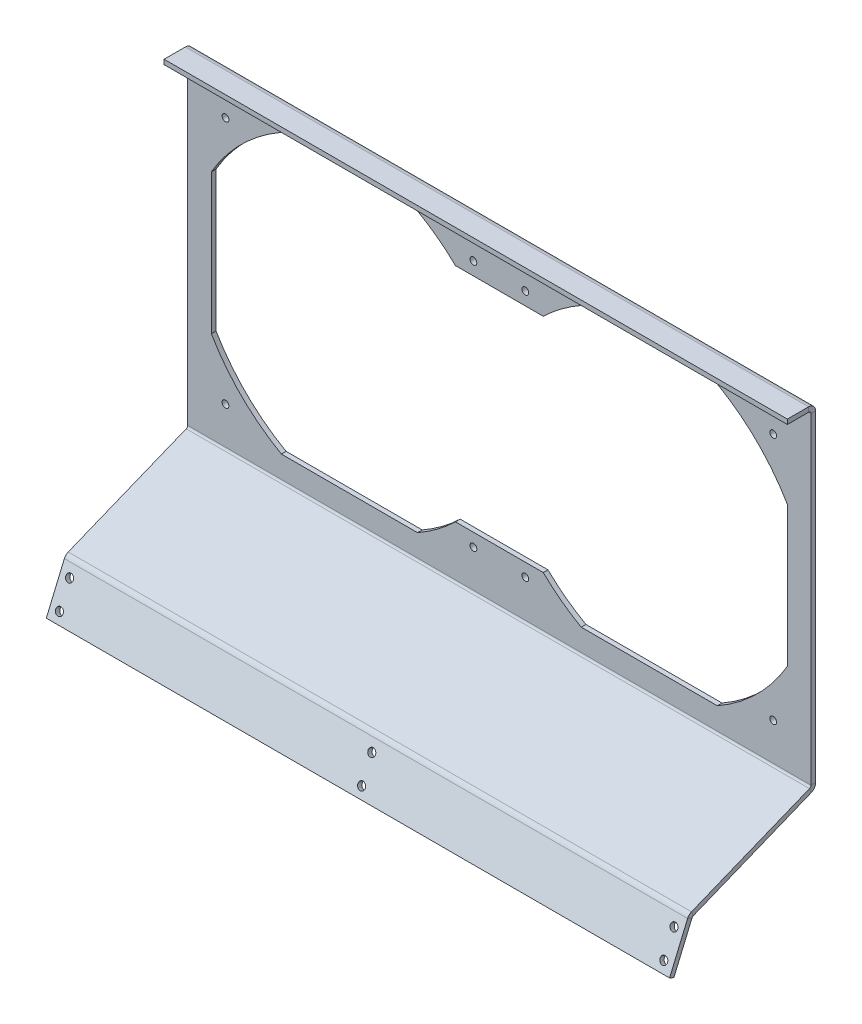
ISO-10303-21;
HEADER;
FILE_DESCRIPTION(('STEP AP214'),'2;1');
FILE_NAME('part.step','',(''),(''),'','','');
FILE_SCHEMA(('AUTOMOTIVE_DESIGN { 1 0 10303 214 1 1 1 1 }'));
ENDSEC;
DATA;
#1=APPLICATION_CONTEXT('core data for automotive mechanical design processes');
#2=APPLICATION_PROTOCOL_DEFINITION('international standard','automotive_design',2000,#1);
#3=PRODUCT_CONTEXT('',#1,'mechanical');
#4=PRODUCT('Part','Part','',(#3));
#5=PRODUCT_RELATED_PRODUCT_CATEGORY('part','',(#4));
#6=PRODUCT_DEFINITION_FORMATION('','',#4);
#7=PRODUCT_DEFINITION_CONTEXT('part definition',#1,'design');
#8=PRODUCT_DEFINITION('design','',#6,#7);
#9=PRODUCT_DEFINITION_SHAPE('','',#8);
#10=(LENGTH_UNIT() NAMED_UNIT(*) SI_UNIT(.MILLI.,.METRE.));
#11=(NAMED_UNIT(*) PLANE_ANGLE_UNIT() SI_UNIT($,.RADIAN.));
#12=(NAMED_UNIT(*) SI_UNIT($,.STERADIAN.) SOLID_ANGLE_UNIT());
#13=UNCERTAINTY_MEASURE_WITH_UNIT(LENGTH_MEASURE(1.E-05),#10,'distance_accuracy_value','');
#14=(GEOMETRIC_REPRESENTATION_CONTEXT(3) GLOBAL_UNCERTAINTY_ASSIGNED_CONTEXT((#13)) GLOBAL_UNIT_ASSIGNED_CONTEXT((#10,
#11,#12)) REPRESENTATION_CONTEXT('',''));
#15=CARTESIAN_POINT('',(0.,0.,0.));
#16=DIRECTION('',(0.,0.,1.));
#17=DIRECTION('',(1.,0.,0.));
#18=AXIS2_PLACEMENT_3D('',#15,#16,#17);
#19=CARTESIAN_POINT('',(0.,0.,-2.));
#20=DIRECTION('',(0.,0.,1.));
#21=DIRECTION('',(1.,0.,0.));
#22=AXIS2_PLACEMENT_3D('',#19,#20,#21);
#23=PLANE('',#22);
#24=CARTESIAN_POINT('',(116.,52.4999999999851,-2.));
#25=DIRECTION('',(0.,0.,-1.));
#26=DIRECTION('',(-1.,0.,0.));
#27=AXIS2_PLACEMENT_3D('',#24,#25,#26);
#28=CIRCLE('',#27,1.44999999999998);
#29=CARTESIAN_POINT('',(114.55,52.4999999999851,-2.));
#30=VERTEX_POINT('',#29);
#31=EDGE_CURVE('E592',#30,#30,#28,.T.);
#32=ORIENTED_EDGE('',*,*,#31,.F.);
#33=EDGE_LOOP('',(#32));
#34=FACE_BOUND('',#33,.T.);
#35=CARTESIAN_POINT('',(116.,-52.5000000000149,-2.));
#36=DIRECTION('',(0.,0.,-1.));
#37=DIRECTION('',(-1.,0.,0.));
#38=AXIS2_PLACEMENT_3D('',#35,#36,#37);
#39=CIRCLE('',#38,1.45);
#40=CARTESIAN_POINT('',(114.55,-52.5000000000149,-2.));
#41=VERTEX_POINT('',#40);
#42=EDGE_CURVE('E582',#41,#41,#39,.T.);
#43=ORIENTED_EDGE('',*,*,#42,.F.);
#44=EDGE_LOOP('',(#43));
#45=FACE_BOUND('',#44,.T.);
#46=CARTESIAN_POINT('',(-10.9999999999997,-52.5000000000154,-2.));
#47=DIRECTION('',(0.,0.,-1.));
#48=DIRECTION('',(-1.,0.,0.));
#49=AXIS2_PLACEMENT_3D('',#46,#47,#48);
#50=CIRCLE('',#49,1.44999999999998);
#51=CARTESIAN_POINT('',(-12.4499999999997,-52.5000000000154,-2.));
#52=VERTEX_POINT('',#51);
#53=EDGE_CURVE('E579',#52,#52,#50,.T.);
#54=ORIENTED_EDGE('',*,*,#53,.F.);
#55=EDGE_LOOP('',(#54));
#56=FACE_BOUND('',#55,.T.);
#57=CARTESIAN_POINT('',(11.0000000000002,-52.5000000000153,-2.));
#58=DIRECTION('',(0.,0.,-1.));
#59=DIRECTION('',(-1.,0.,0.));
#60=AXIS2_PLACEMENT_3D('',#57,#58,#59);
#61=CIRCLE('',#60,1.44999999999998);
#62=CARTESIAN_POINT('',(9.55000000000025,-52.5000000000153,-2.));
#63=VERTEX_POINT('',#62);
#64=EDGE_CURVE('E576',#63,#63,#61,.T.);
#65=ORIENTED_EDGE('',*,*,#64,.F.);
#66=EDGE_LOOP('',(#65));
#67=FACE_BOUND('',#66,.T.);
#68=CARTESIAN_POINT('',(10.9999999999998,52.4999999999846,-2.));
#69=DIRECTION('',(0.,0.,-1.));
#70=DIRECTION('',(-1.,0.,0.));
#71=AXIS2_PLACEMENT_3D('',#68,#69,#70);
#72=CIRCLE('',#71,1.44999999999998);
#73=CARTESIAN_POINT('',(9.54999999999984,52.4999999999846,-2.));
#74=VERTEX_POINT('',#73);
#75=EDGE_CURVE('E572',#74,#74,#72,.T.);
#76=ORIENTED_EDGE('',*,*,#75,.F.);
#77=EDGE_LOOP('',(#76));
#78=FACE_BOUND('',#77,.T.);
#79=CARTESIAN_POINT('',(-11.0000000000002,52.4999999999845,-2.));
#80=DIRECTION('',(0.,0.,-1.));
#81=DIRECTION('',(-1.,0.,0.));
#82=AXIS2_PLACEMENT_3D('',#79,#80,#81);
#83=CIRCLE('',#82,1.44999999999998);
#84=CARTESIAN_POINT('',(-12.4500000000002,52.4999999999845,-2.));
#85=VERTEX_POINT('',#84);
#86=EDGE_CURVE('E568',#85,#85,#83,.T.);
#87=ORIENTED_EDGE('',*,*,#86,.F.);
#88=EDGE_LOOP('',(#87));
#89=FACE_BOUND('',#88,.T.);
#90=CARTESIAN_POINT('',(-116.,52.4999999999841,-2.));
#91=DIRECTION('',(0.,0.,-1.));
#92=DIRECTION('',(-1.,0.,0.));
#93=AXIS2_PLACEMENT_3D('',#90,#91,#92);
#94=CIRCLE('',#93,1.45);
#95=CARTESIAN_POINT('',(-117.45,52.4999999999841,-2.));
#96=VERTEX_POINT('',#95);
#97=EDGE_CURVE('E564',#96,#96,#94,.T.);
#98=ORIENTED_EDGE('',*,*,#97,.F.);
#99=EDGE_LOOP('',(#98));
#100=FACE_BOUND('',#99,.T.);
#101=CARTESIAN_POINT('',(-116.,-52.5000000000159,-2.));
#102=DIRECTION('',(0.,0.,-1.));
#103=DIRECTION('',(-1.,0.,0.));
#104=AXIS2_PLACEMENT_3D('',#101,#102,#103);
#105=CIRCLE('',#104,1.45);
#106=CARTESIAN_POINT('',(-117.45,-52.5000000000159,-2.));
#107=VERTEX_POINT('',#106);
#108=EDGE_CURVE('E560',#107,#107,#105,.T.);
#109=ORIENTED_EDGE('',*,*,#108,.F.);
#110=EDGE_LOOP('',(#109));
#111=FACE_BOUND('',#110,.T.);
#112=DIRECTION('',(1.,0.,0.));
#113=VECTOR('',#112,1.);
#114=CARTESIAN_POINT('',(34.6741151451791,-58.9999999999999,-2.));
#115=LINE('',#114,#113);
#116=CARTESIAN_POINT('',(34.6741151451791,-58.9999999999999,-2.));
#117=VERTEX_POINT('',#116);
#118=CARTESIAN_POINT('',(92.3258848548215,-58.9999999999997,-2.));
#119=VERTEX_POINT('',#118);
#120=EDGE_CURVE('E470',#117,#119,#115,.T.);
#121=ORIENTED_EDGE('',*,*,#120,.T.);
#122=CARTESIAN_POINT('',(52.8933982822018,10.6066017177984,-2.));
#123=DIRECTION('',(0.,0.,1.));
#124=DIRECTION('',(1.,0.,0.));
#125=AXIS2_PLACEMENT_3D('',#122,#123,#124);
#126=CIRCLE('',#125,80.);
#127=CARTESIAN_POINT('',(122.,-29.6957257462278,-2.));
#128=VERTEX_POINT('',#127);
#129=EDGE_CURVE('E424',#119,#128,#126,.T.);
#130=ORIENTED_EDGE('',*,*,#129,.T.);
#131=DIRECTION('',(0.,1.,0.));
#132=VECTOR('',#131,1.);
#133=CARTESIAN_POINT('',(122.,-29.6957257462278,-2.));
#134=LINE('',#133,#132);
#135=CARTESIAN_POINT('',(122.,29.6957257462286,-2.));
#136=VERTEX_POINT('',#135);
#137=EDGE_CURVE('E427',#128,#136,#134,.T.);
#138=ORIENTED_EDGE('',*,*,#137,.T.);
#139=CARTESIAN_POINT('',(52.8933982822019,-10.6066017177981,-2.));
#140=DIRECTION('',(0.,0.,1.));
#141=DIRECTION('',(1.,0.,0.));
#142=AXIS2_PLACEMENT_3D('',#139,#140,#141);
#143=CIRCLE('',#142,80.);
#144=CARTESIAN_POINT('',(92.325884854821,59.0000000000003,-2.));
#145=VERTEX_POINT('',#144);
#146=EDGE_CURVE('E431',#136,#145,#143,.T.);
#147=ORIENTED_EDGE('',*,*,#146,.T.);
#148=DIRECTION('',(-1.,0.,0.));
#149=VECTOR('',#148,1.);
#150=CARTESIAN_POINT('',(92.325884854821,59.0000000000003,-2.));
#151=LINE('',#150,#149);
#152=CARTESIAN_POINT('',(34.6741151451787,59.0000000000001,-2.));
#153=VERTEX_POINT('',#152);
#154=EDGE_CURVE('E434',#145,#153,#151,.T.);
#155=ORIENTED_EDGE('',*,*,#154,.T.);
#156=CARTESIAN_POINT('',(74.1066017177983,-10.606601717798,-2.));
#157=DIRECTION('',(0.,0.,1.));
#158=DIRECTION('',(1.,0.,0.));
#159=AXIS2_PLACEMENT_3D('',#156,#157,#158);
#160=CIRCLE('',#159,80.);
#161=CARTESIAN_POINT('',(18.5955268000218,47.,-2.));
#162=VERTEX_POINT('',#161);
#163=EDGE_CURVE('E437',#153,#162,#160,.T.);
#164=ORIENTED_EDGE('',*,*,#163,.T.);
#165=DIRECTION('',(-1.,0.,0.));
#166=VECTOR('',#165,1.);
#167=CARTESIAN_POINT('',(18.5955268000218,47.,-2.));
#168=LINE('',#167,#166);
#169=CARTESIAN_POINT('',(-18.5955268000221,46.9999999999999,-2.));
#170=VERTEX_POINT('',#169);
#171=EDGE_CURVE('E440',#162,#170,#168,.T.);
#172=ORIENTED_EDGE('',*,*,#171,.T.);
#173=CARTESIAN_POINT('',(-74.1066017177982,-10.6066017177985,-2.));
#174=DIRECTION('',(0.,0.,1.));
#175=DIRECTION('',(1.,0.,0.));
#176=AXIS2_PLACEMENT_3D('',#173,#174,#175);
#177=CIRCLE('',#176,80.);
#178=CARTESIAN_POINT('',(-34.674115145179,58.9999999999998,-2.));
#179=VERTEX_POINT('',#178);
#180=EDGE_CURVE('E443',#170,#179,#177,.T.);
#181=ORIENTED_EDGE('',*,*,#180,.T.);
#182=DIRECTION('',(-1.,0.,0.));
#183=VECTOR('',#182,1.);
#184=CARTESIAN_POINT('',(-34.674115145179,58.9999999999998,-2.));
#185=LINE('',#184,#183);
#186=CARTESIAN_POINT('',(-92.3258848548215,58.9999999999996,-2.));
#187=VERTEX_POINT('',#186);
#188=EDGE_CURVE('E446',#179,#187,#185,.T.);
#189=ORIENTED_EDGE('',*,*,#188,.T.);
#190=CARTESIAN_POINT('',(-52.8933982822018,-10.6066017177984,-2.));
#191=DIRECTION('',(0.,0.,1.));
#192=DIRECTION('',(1.,0.,0.));
#193=AXIS2_PLACEMENT_3D('',#190,#191,#192);
#194=CIRCLE('',#193,80.);
#195=CARTESIAN_POINT('',(-122.,29.6957257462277,-2.));
#196=VERTEX_POINT('',#195);
#197=EDGE_CURVE('E449',#187,#196,#194,.T.);
#198=ORIENTED_EDGE('',*,*,#197,.T.);
#199=DIRECTION('',(0.,-1.,0.));
#200=VECTOR('',#199,1.);
#201=CARTESIAN_POINT('',(-122.,29.6957257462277,-2.));
#202=LINE('',#201,#200);
#203=CARTESIAN_POINT('',(-122.,-29.6957257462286,-2.));
#204=VERTEX_POINT('',#203);
#205=EDGE_CURVE('E452',#196,#204,#202,.T.);
#206=ORIENTED_EDGE('',*,*,#205,.T.);
#207=CARTESIAN_POINT('',(-52.8933982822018,10.606601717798,-2.));
#208=DIRECTION('',(0.,0.,1.));
#209=DIRECTION('',(1.,0.,0.));
#210=AXIS2_PLACEMENT_3D('',#207,#208,#209);
#211=CIRCLE('',#210,80.);
#212=CARTESIAN_POINT('',(-92.3258848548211,-59.0000000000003,-2.));
#213=VERTEX_POINT('',#212);
#214=EDGE_CURVE('E455',#204,#213,#211,.T.);
#215=ORIENTED_EDGE('',*,*,#214,.T.);
#216=DIRECTION('',(1.,0.,0.));
#217=VECTOR('',#216,1.);
#218=CARTESIAN_POINT('',(-92.3258848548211,-59.0000000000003,-2.));
#219=LINE('',#218,#217);
#220=CARTESIAN_POINT('',(-34.6741151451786,-59.0000000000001,-2.));
#221=VERTEX_POINT('',#220);
#222=EDGE_CURVE('E458',#213,#221,#219,.T.);
#223=ORIENTED_EDGE('',*,*,#222,.T.);
#224=CARTESIAN_POINT('',(-74.1066017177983,10.606601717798,-2.));
#225=DIRECTION('',(0.,0.,1.));
#226=DIRECTION('',(1.,0.,0.));
#227=AXIS2_PLACEMENT_3D('',#224,#225,#226);
#228=CIRCLE('',#227,80.);
#229=CARTESIAN_POINT('',(-18.5955268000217,-47.,-2.));
#230=VERTEX_POINT('',#229);
#231=EDGE_CURVE('E461',#221,#230,#228,.T.);
#232=ORIENTED_EDGE('',*,*,#231,.T.);
#233=DIRECTION('',(1.,0.,0.));
#234=VECTOR('',#233,1.);
#235=CARTESIAN_POINT('',(-18.5955268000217,-47.,-2.));
#236=LINE('',#235,#234);
#237=CARTESIAN_POINT('',(18.5955268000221,-46.9999999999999,-2.));
#238=VERTEX_POINT('',#237);
#239=EDGE_CURVE('E464',#230,#238,#236,.T.);
#240=ORIENTED_EDGE('',*,*,#239,.T.);
#241=CARTESIAN_POINT('',(74.1066017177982,10.6066017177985,-2.));
#242=DIRECTION('',(0.,0.,1.));
#243=DIRECTION('',(1.,0.,0.));
#244=AXIS2_PLACEMENT_3D('',#241,#242,#243);
#245=CIRCLE('',#244,80.);
#246=EDGE_CURVE('E467',#238,#117,#245,.T.);
#247=ORIENTED_EDGE('',*,*,#246,.T.);
#248=EDGE_LOOP('',(#121,#130,#138,#147,#155,#164,#172,#181,#189,#198,#206,#215,#223,#232,#240,#247));
#249=FACE_BOUND('',#248,.T.);
#250=DIRECTION('',(-1.,0.,0.));
#251=VECTOR('',#250,1.);
#252=CARTESIAN_POINT('',(-132.,67.9999999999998,-1.99999999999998));
#253=LINE('',#252,#251);
#254=CARTESIAN_POINT('',(-132.,67.9999999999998,-1.99999999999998));
#255=VERTEX_POINT('',#254);
#256=CARTESIAN_POINT('',(132.,67.9999999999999,-2.));
#257=VERTEX_POINT('',#256);
#258=EDGE_CURVE('E268',#255,#257,#253,.F.);
#259=ORIENTED_EDGE('',*,*,#258,.T.);
#260=DIRECTION('',(0.,1.,0.));
#261=VECTOR('',#260,1.);
#262=CARTESIAN_POINT('',(132.,68.9999999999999,-2.));
#263=LINE('',#262,#261);
#264=CARTESIAN_POINT('',(132.,-68.3254914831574,-1.99999999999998));
#265=VERTEX_POINT('',#264);
#266=EDGE_CURVE('E13',#265,#257,#263,.T.);
#267=ORIENTED_EDGE('',*,*,#266,.F.);
#268=DIRECTION('',(1.,0.,0.));
#269=VECTOR('',#268,1.);
#270=CARTESIAN_POINT('',(132.,-68.3254914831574,-1.99999999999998));
#271=LINE('',#270,#269);
#272=CARTESIAN_POINT('',(-132.,-68.3254914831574,-2.));
#273=VERTEX_POINT('',#272);
#274=EDGE_CURVE('E402',#265,#273,#271,.F.);
#275=ORIENTED_EDGE('',*,*,#274,.T.);
#276=DIRECTION('',(0.,-1.,0.));
#277=VECTOR('',#276,1.);
#278=CARTESIAN_POINT('',(-132.,68.9999999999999,-2.));
#279=LINE('',#278,#277);
#280=EDGE_CURVE('E58',#255,#273,#279,.T.);
#281=ORIENTED_EDGE('',*,*,#280,.F.);
#282=EDGE_LOOP('',(#259,#267,#275,#281));
#283=FACE_BOUND('',#282,.T.);
#284=ADVANCED_FACE('F49',(#34,#45,#56,#67,#78,#89,#100,#111,#249,#283),#23,.F.);
#285=CARTESIAN_POINT('',(0.,0.,0.));
#286=DIRECTION('',(0.,0.,1.));
#287=DIRECTION('',(1.,0.,0.));
#288=AXIS2_PLACEMENT_3D('',#285,#286,#287);
#289=PLANE('',#288);
#290=CARTESIAN_POINT('',(116.,52.4999999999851,0.));
#291=DIRECTION('',(0.,0.,1.));
#292=DIRECTION('',(1.,0.,0.));
#293=AXIS2_PLACEMENT_3D('',#290,#291,#292);
#294=CIRCLE('',#293,1.44999999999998);
#295=CARTESIAN_POINT('',(117.45,52.4999999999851,0.));
#296=VERTEX_POINT('',#295);
#297=EDGE_CURVE('E53',#296,#296,#294,.T.);
#298=ORIENTED_EDGE('',*,*,#297,.F.);
#299=EDGE_LOOP('',(#298));
#300=FACE_BOUND('',#299,.T.);
#301=CARTESIAN_POINT('',(116.,-52.5000000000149,0.));
#302=DIRECTION('',(0.,0.,1.));
#303=DIRECTION('',(1.,0.,0.));
#304=AXIS2_PLACEMENT_3D('',#301,#302,#303);
#305=CIRCLE('',#304,1.45);
#306=CARTESIAN_POINT('',(117.45,-52.5000000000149,0.));
#307=VERTEX_POINT('',#306);
#308=EDGE_CURVE('E580',#307,#307,#305,.T.);
#309=ORIENTED_EDGE('',*,*,#308,.F.);
#310=EDGE_LOOP('',(#309));
#311=FACE_BOUND('',#310,.T.);
#312=CARTESIAN_POINT('',(-10.9999999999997,-52.5000000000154,0.));
#313=DIRECTION('',(0.,0.,1.));
#314=DIRECTION('',(1.,0.,0.));
#315=AXIS2_PLACEMENT_3D('',#312,#313,#314);
#316=CIRCLE('',#315,1.44999999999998);
#317=CARTESIAN_POINT('',(-9.54999999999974,-52.5000000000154,0.));
#318=VERTEX_POINT('',#317);
#319=EDGE_CURVE('E577',#318,#318,#316,.T.);
#320=ORIENTED_EDGE('',*,*,#319,.F.);
#321=EDGE_LOOP('',(#320));
#322=FACE_BOUND('',#321,.T.);
#323=CARTESIAN_POINT('',(11.0000000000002,-52.5000000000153,0.));
#324=DIRECTION('',(0.,0.,1.));
#325=DIRECTION('',(1.,0.,0.));
#326=AXIS2_PLACEMENT_3D('',#323,#324,#325);
#327=CIRCLE('',#326,1.44999999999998);
#328=CARTESIAN_POINT('',(12.4500000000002,-52.5000000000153,0.));
#329=VERTEX_POINT('',#328);
#330=EDGE_CURVE('E573',#329,#329,#327,.T.);
#331=ORIENTED_EDGE('',*,*,#330,.F.);
#332=EDGE_LOOP('',(#331));
#333=FACE_BOUND('',#332,.T.);
#334=CARTESIAN_POINT('',(10.9999999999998,52.4999999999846,0.));
#335=DIRECTION('',(0.,0.,1.));
#336=DIRECTION('',(1.,0.,0.));
#337=AXIS2_PLACEMENT_3D('',#334,#335,#336);
#338=CIRCLE('',#337,1.44999999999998);
#339=CARTESIAN_POINT('',(12.4499999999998,52.4999999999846,0.));
#340=VERTEX_POINT('',#339);
#341=EDGE_CURVE('E569',#340,#340,#338,.T.);
#342=ORIENTED_EDGE('',*,*,#341,.F.);
#343=EDGE_LOOP('',(#342));
#344=FACE_BOUND('',#343,.T.);
#345=CARTESIAN_POINT('',(-11.0000000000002,52.4999999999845,0.));
#346=DIRECTION('',(0.,0.,1.));
#347=DIRECTION('',(1.,0.,0.));
#348=AXIS2_PLACEMENT_3D('',#345,#346,#347);
#349=CIRCLE('',#348,1.44999999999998);
#350=CARTESIAN_POINT('',(-9.55000000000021,52.4999999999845,0.));
#351=VERTEX_POINT('',#350);
#352=EDGE_CURVE('E565',#351,#351,#349,.T.);
#353=ORIENTED_EDGE('',*,*,#352,.F.);
#354=EDGE_LOOP('',(#353));
#355=FACE_BOUND('',#354,.T.);
#356=CARTESIAN_POINT('',(-116.,52.4999999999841,0.));
#357=DIRECTION('',(0.,0.,1.));
#358=DIRECTION('',(1.,0.,0.));
#359=AXIS2_PLACEMENT_3D('',#356,#357,#358);
#360=CIRCLE('',#359,1.45);
#361=CARTESIAN_POINT('',(-114.55,52.4999999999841,0.));
#362=VERTEX_POINT('',#361);
#363=EDGE_CURVE('E561',#362,#362,#360,.T.);
#364=ORIENTED_EDGE('',*,*,#363,.F.);
#365=EDGE_LOOP('',(#364));
#366=FACE_BOUND('',#365,.T.);
#367=CARTESIAN_POINT('',(-116.,-52.5000000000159,0.));
#368=DIRECTION('',(0.,0.,1.));
#369=DIRECTION('',(1.,0.,0.));
#370=AXIS2_PLACEMENT_3D('',#367,#368,#369);
#371=CIRCLE('',#370,1.45);
#372=CARTESIAN_POINT('',(-114.55,-52.5000000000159,0.));
#373=VERTEX_POINT('',#372);
#374=EDGE_CURVE('E556',#373,#373,#371,.T.);
#375=ORIENTED_EDGE('',*,*,#374,.F.);
#376=EDGE_LOOP('',(#375));
#377=FACE_BOUND('',#376,.T.);
#378=CARTESIAN_POINT('',(52.8933982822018,10.6066017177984,0.));
#379=DIRECTION('',(0.,0.,1.));
#380=DIRECTION('',(1.,0.,0.));
#381=AXIS2_PLACEMENT_3D('',#378,#379,#380);
#382=CIRCLE('',#381,80.);
#383=CARTESIAN_POINT('',(92.3258848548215,-58.9999999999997,0.));
#384=VERTEX_POINT('',#383);
#385=CARTESIAN_POINT('',(122.,-29.6957257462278,0.));
#386=VERTEX_POINT('',#385);
#387=EDGE_CURVE('E421',#384,#386,#382,.T.);
#388=ORIENTED_EDGE('',*,*,#387,.F.);
#389=DIRECTION('',(1.,0.,0.));
#390=VECTOR('',#389,1.);
#391=CARTESIAN_POINT('',(34.6741151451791,-58.9999999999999,0.));
#392=LINE('',#391,#390);
#393=CARTESIAN_POINT('',(34.6741151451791,-58.9999999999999,0.));
#394=VERTEX_POINT('',#393);
#395=EDGE_CURVE('E428',#394,#384,#392,.T.);
#396=ORIENTED_EDGE('',*,*,#395,.F.);
#397=CARTESIAN_POINT('',(74.1066017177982,10.6066017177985,0.));
#398=DIRECTION('',(0.,0.,1.));
#399=DIRECTION('',(1.,0.,0.));
#400=AXIS2_PLACEMENT_3D('',#397,#398,#399);
#401=CIRCLE('',#400,80.);
#402=CARTESIAN_POINT('',(18.5955268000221,-46.9999999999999,0.));
#403=VERTEX_POINT('',#402);
#404=EDGE_CURVE('E514',#403,#394,#401,.T.);
#405=ORIENTED_EDGE('',*,*,#404,.F.);
#406=DIRECTION('',(1.,0.,0.));
#407=VECTOR('',#406,1.);
#408=CARTESIAN_POINT('',(-18.5955268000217,-47.,0.));
#409=LINE('',#408,#407);
#410=CARTESIAN_POINT('',(-18.5955268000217,-47.,0.));
#411=VERTEX_POINT('',#410);
#412=EDGE_CURVE('E511',#411,#403,#409,.T.);
#413=ORIENTED_EDGE('',*,*,#412,.F.);
#414=CARTESIAN_POINT('',(-74.1066017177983,10.606601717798,0.));
#415=DIRECTION('',(0.,0.,1.));
#416=DIRECTION('',(1.,0.,0.));
#417=AXIS2_PLACEMENT_3D('',#414,#415,#416);
#418=CIRCLE('',#417,80.);
#419=CARTESIAN_POINT('',(-34.6741151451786,-59.0000000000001,0.));
#420=VERTEX_POINT('',#419);
#421=EDGE_CURVE('E508',#420,#411,#418,.T.);
#422=ORIENTED_EDGE('',*,*,#421,.F.);
#423=DIRECTION('',(1.,0.,0.));
#424=VECTOR('',#423,1.);
#425=CARTESIAN_POINT('',(-92.3258848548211,-59.0000000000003,0.));
#426=LINE('',#425,#424);
#427=CARTESIAN_POINT('',(-92.3258848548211,-59.0000000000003,0.));
#428=VERTEX_POINT('',#427);
#429=EDGE_CURVE('E505',#428,#420,#426,.T.);
#430=ORIENTED_EDGE('',*,*,#429,.F.);
#431=CARTESIAN_POINT('',(-52.8933982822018,10.606601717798,0.));
#432=DIRECTION('',(0.,0.,1.));
#433=DIRECTION('',(1.,0.,0.));
#434=AXIS2_PLACEMENT_3D('',#431,#432,#433);
#435=CIRCLE('',#434,80.);
#436=CARTESIAN_POINT('',(-122.,-29.6957257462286,0.));
#437=VERTEX_POINT('',#436);
#438=EDGE_CURVE('E502',#437,#428,#435,.T.);
#439=ORIENTED_EDGE('',*,*,#438,.F.);
#440=DIRECTION('',(0.,-1.,0.));
#441=VECTOR('',#440,1.);
#442=CARTESIAN_POINT('',(-122.,29.6957257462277,0.));
#443=LINE('',#442,#441);
#444=CARTESIAN_POINT('',(-122.,29.6957257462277,0.));
#445=VERTEX_POINT('',#444);
#446=EDGE_CURVE('E499',#445,#437,#443,.T.);
#447=ORIENTED_EDGE('',*,*,#446,.F.);
#448=CARTESIAN_POINT('',(-52.8933982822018,-10.6066017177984,0.));
#449=DIRECTION('',(0.,0.,1.));
#450=DIRECTION('',(1.,0.,0.));
#451=AXIS2_PLACEMENT_3D('',#448,#449,#450);
#452=CIRCLE('',#451,80.);
#453=CARTESIAN_POINT('',(-92.3258848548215,58.9999999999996,0.));
#454=VERTEX_POINT('',#453);
#455=EDGE_CURVE('E496',#454,#445,#452,.T.);
#456=ORIENTED_EDGE('',*,*,#455,.F.);
#457=DIRECTION('',(-1.,0.,0.));
#458=VECTOR('',#457,1.);
#459=CARTESIAN_POINT('',(-34.674115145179,58.9999999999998,0.));
#460=LINE('',#459,#458);
#461=CARTESIAN_POINT('',(-34.674115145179,58.9999999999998,0.));
#462=VERTEX_POINT('',#461);
#463=EDGE_CURVE('E493',#462,#454,#460,.T.);
#464=ORIENTED_EDGE('',*,*,#463,.F.);
#465=CARTESIAN_POINT('',(-74.1066017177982,-10.6066017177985,0.));
#466=DIRECTION('',(0.,0.,1.));
#467=DIRECTION('',(1.,0.,0.));
#468=AXIS2_PLACEMENT_3D('',#465,#466,#467);
#469=CIRCLE('',#468,80.);
#470=CARTESIAN_POINT('',(-18.5955268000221,46.9999999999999,0.));
#471=VERTEX_POINT('',#470);
#472=EDGE_CURVE('E490',#471,#462,#469,.T.);
#473=ORIENTED_EDGE('',*,*,#472,.F.);
#474=DIRECTION('',(-1.,0.,0.));
#475=VECTOR('',#474,1.);
#476=CARTESIAN_POINT('',(18.5955268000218,47.,0.));
#477=LINE('',#476,#475);
#478=CARTESIAN_POINT('',(18.5955268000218,47.,0.));
#479=VERTEX_POINT('',#478);
#480=EDGE_CURVE('E487',#479,#471,#477,.T.);
#481=ORIENTED_EDGE('',*,*,#480,.F.);
#482=CARTESIAN_POINT('',(74.1066017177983,-10.606601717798,0.));
#483=DIRECTION('',(0.,0.,1.));
#484=DIRECTION('',(1.,0.,0.));
#485=AXIS2_PLACEMENT_3D('',#482,#483,#484);
#486=CIRCLE('',#485,80.);
#487=CARTESIAN_POINT('',(34.6741151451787,59.0000000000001,0.));
#488=VERTEX_POINT('',#487);
#489=EDGE_CURVE('E484',#488,#479,#486,.T.);
#490=ORIENTED_EDGE('',*,*,#489,.F.);
#491=DIRECTION('',(-1.,0.,0.));
#492=VECTOR('',#491,1.);
#493=CARTESIAN_POINT('',(92.325884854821,59.0000000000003,0.));
#494=LINE('',#493,#492);
#495=CARTESIAN_POINT('',(92.325884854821,59.0000000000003,0.));
#496=VERTEX_POINT('',#495);
#497=EDGE_CURVE('E481',#496,#488,#494,.T.);
#498=ORIENTED_EDGE('',*,*,#497,.F.);
#499=CARTESIAN_POINT('',(52.8933982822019,-10.6066017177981,0.));
#500=DIRECTION('',(0.,0.,1.));
#501=DIRECTION('',(1.,0.,0.));
#502=AXIS2_PLACEMENT_3D('',#499,#500,#501);
#503=CIRCLE('',#502,80.);
#504=CARTESIAN_POINT('',(122.,29.6957257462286,0.));
#505=VERTEX_POINT('',#504);
#506=EDGE_CURVE('E478',#505,#496,#503,.T.);
#507=ORIENTED_EDGE('',*,*,#506,.F.);
#508=DIRECTION('',(0.,1.,0.));
#509=VECTOR('',#508,1.);
#510=CARTESIAN_POINT('',(122.,-29.6957257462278,0.));
#511=LINE('',#510,#509);
#512=EDGE_CURVE('E475',#386,#505,#511,.T.);
#513=ORIENTED_EDGE('',*,*,#512,.F.);
#514=EDGE_LOOP('',(#388,#396,#405,#413,#422,#430,#439,#447,#456,#464,#473,#481,#490,#498,#507,#513));
#515=FACE_BOUND('',#514,.T.);
#516=DIRECTION('',(0.,1.,0.));
#517=VECTOR('',#516,1.);
#518=CARTESIAN_POINT('',(132.,68.9999999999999,0.));
#519=LINE('',#518,#517);
#520=CARTESIAN_POINT('',(132.,-68.3254914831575,0.));
#521=VERTEX_POINT('',#520);
#522=CARTESIAN_POINT('',(132.,67.9999999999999,0.));
#523=VERTEX_POINT('',#522);
#524=EDGE_CURVE('E552',#521,#523,#519,.T.);
#525=ORIENTED_EDGE('',*,*,#524,.T.);
#526=DIRECTION('',(-1.,0.,0.));
#527=VECTOR('',#526,1.);
#528=CARTESIAN_POINT('',(-132.,67.9999999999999,0.));
#529=LINE('',#528,#527);
#530=CARTESIAN_POINT('',(-132.,67.9999999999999,0.));
#531=VERTEX_POINT('',#530);
#532=EDGE_CURVE('E319',#531,#523,#529,.F.);
#533=ORIENTED_EDGE('',*,*,#532,.F.);
#534=DIRECTION('',(0.,-1.,0.));
#535=VECTOR('',#534,1.);
#536=CARTESIAN_POINT('',(-132.,68.9999999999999,0.));
#537=LINE('',#536,#535);
#538=CARTESIAN_POINT('',(-132.,-68.3254914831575,0.));
#539=VERTEX_POINT('',#538);
#540=EDGE_CURVE('E521',#531,#539,#537,.T.);
#541=ORIENTED_EDGE('',*,*,#540,.T.);
#542=DIRECTION('',(1.,0.,0.));
#543=VECTOR('',#542,1.);
#544=CARTESIAN_POINT('',(132.,-68.3254914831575,0.));
#545=LINE('',#544,#543);
#546=EDGE_CURVE('E74',#521,#539,#545,.F.);
#547=ORIENTED_EDGE('',*,*,#546,.F.);
#548=EDGE_LOOP('',(#525,#533,#541,#547));
#549=FACE_BOUND('',#548,.T.);
#550=ADVANCED_FACE('F636',(#300,#311,#322,#333,#344,#355,#366,#377,#515,#549),#289,.T.);
#551=CARTESIAN_POINT('',(-132.,68.9999999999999,-2.));
#552=DIRECTION('',(-1.,0.,0.));
#553=DIRECTION('',(0.,-1.,0.));
#554=AXIS2_PLACEMENT_3D('',#551,#552,#553);
#555=PLANE('',#554);
#556=ORIENTED_EDGE('',*,*,#540,.F.);
#557=DIRECTION('',(0.,0.,-1.));
#558=VECTOR('',#557,1.);
#559=CARTESIAN_POINT('',(-132.,67.9999999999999,0.));
#560=LINE('',#559,#558);
#561=EDGE_CURVE('E315',#531,#255,#560,.T.);
#562=ORIENTED_EDGE('',*,*,#561,.T.);
#563=ORIENTED_EDGE('',*,*,#280,.T.);
#564=DIRECTION('',(0.,0.,-1.));
#565=VECTOR('',#564,1.);
#566=CARTESIAN_POINT('',(-132.,-68.3254914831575,0.));
#567=LINE('',#566,#565);
#568=EDGE_CURVE('E418',#539,#273,#567,.T.);
#569=ORIENTED_EDGE('',*,*,#568,.F.);
#570=EDGE_LOOP('',(#556,#562,#563,#569));
#571=FACE_BOUND('',#570,.T.);
#572=ADVANCED_FACE('F51',(#571),#555,.T.);
#573=CARTESIAN_POINT('',(-132.,-70.8543677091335,-0.749213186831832));
#574=DIRECTION('',(1.,0.,0.));
#575=DIRECTION('',(0.,1.,0.));
#576=AXIS2_PLACEMENT_3D('',#573,#574,#575);
#577=PLANE('',#576);
#578=DIRECTION('',(0.,0.927183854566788,0.374606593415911));
#579=VECTOR('',#578,1.);
#580=CARTESIAN_POINT('',(-132.,-91.3025632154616,49.8618466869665));
#581=LINE('',#580,#579);
#582=CARTESIAN_POINT('',(-132.,-91.3025632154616,49.8618466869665));
#583=VERTEX_POINT('',#582);
#584=CARTESIAN_POINT('',(-132.,-89.448195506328,50.6110598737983));
#585=VERTEX_POINT('',#584);
#586=EDGE_CURVE('E366',#583,#585,#581,.T.);
#587=ORIENTED_EDGE('',*,*,#586,.T.);
#588=DIRECTION('',(0.,0.374606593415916,-0.927183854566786));
#589=VECTOR('',#588,1.);
#590=CARTESIAN_POINT('',(-132.,-68.9999999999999,0.));
#591=LINE('',#590,#589);
#592=CARTESIAN_POINT('',(-132.,-69.2526753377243,0.625393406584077));
#593=VERTEX_POINT('',#592);
#594=EDGE_CURVE('E391',#585,#593,#591,.T.);
#595=ORIENTED_EDGE('',*,*,#594,.T.);
#596=DIRECTION('',(0.,-0.927183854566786,-0.374606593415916));
#597=VECTOR('',#596,1.);
#598=CARTESIAN_POINT('',(-132.,-69.2526753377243,0.625393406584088));
#599=LINE('',#598,#597);
#600=CARTESIAN_POINT('',(-132.,-71.1070430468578,-0.12381978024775));
#601=VERTEX_POINT('',#600);
#602=EDGE_CURVE('E378',#593,#601,#599,.T.);
#603=ORIENTED_EDGE('',*,*,#602,.T.);
#604=DIRECTION('',(0.,0.374606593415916,-0.927183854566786));
#605=VECTOR('',#604,1.);
#606=CARTESIAN_POINT('',(-132.,-70.8543677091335,-0.749213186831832));
#607=LINE('',#606,#605);
#608=EDGE_CURVE('E392',#583,#601,#607,.T.);
#609=ORIENTED_EDGE('',*,*,#608,.F.);
#610=EDGE_LOOP('',(#587,#595,#603,#609));
#611=FACE_BOUND('',#610,.T.);
#612=ADVANCED_FACE('F677',(#611),#577,.F.);
#613=CARTESIAN_POINT('',(132.,-91.4577303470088,50.2458988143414));
#614=DIRECTION('',(-1.,0.,0.));
#615=DIRECTION('',(0.,-1.,0.));
#616=AXIS2_PLACEMENT_3D('',#613,#614,#615);
#617=PLANE('',#616);
#618=DIRECTION('',(0.,0.927183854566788,0.374606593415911));
#619=VECTOR('',#618,1.);
#620=CARTESIAN_POINT('',(132.,-91.3025632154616,49.8618466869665));
#621=LINE('',#620,#619);
#622=CARTESIAN_POINT('',(132.,-91.3025632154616,49.8618466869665));
#623=VERTEX_POINT('',#622);
#624=CARTESIAN_POINT('',(132.,-89.448195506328,50.6110598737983));
#625=VERTEX_POINT('',#624);
#626=EDGE_CURVE('E376',#623,#625,#621,.T.);
#627=ORIENTED_EDGE('',*,*,#626,.F.);
#628=DIRECTION('',(0.,-0.374606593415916,0.927183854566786));
#629=VECTOR('',#628,1.);
#630=CARTESIAN_POINT('',(132.,-91.4577303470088,50.2458988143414));
#631=LINE('',#630,#629);
#632=CARTESIAN_POINT('',(132.,-71.1070430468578,-0.123819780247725));
#633=VERTEX_POINT('',#632);
#634=EDGE_CURVE('E394',#633,#623,#631,.T.);
#635=ORIENTED_EDGE('',*,*,#634,.F.);
#636=DIRECTION('',(0.,-0.927183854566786,-0.374606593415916));
#637=VECTOR('',#636,1.);
#638=CARTESIAN_POINT('',(132.,-69.2526753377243,0.625393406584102));
#639=LINE('',#638,#637);
#640=CARTESIAN_POINT('',(132.,-69.2526753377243,0.625393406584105));
#641=VERTEX_POINT('',#640);
#642=EDGE_CURVE('E383',#641,#633,#639,.T.);
#643=ORIENTED_EDGE('',*,*,#642,.F.);
#644=DIRECTION('',(0.,-0.374606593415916,0.927183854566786));
#645=VECTOR('',#644,1.);
#646=CARTESIAN_POINT('',(132.,-89.6033626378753,50.9951120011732));
#647=LINE('',#646,#645);
#648=EDGE_CURVE('E395',#641,#625,#647,.T.);
#649=ORIENTED_EDGE('',*,*,#648,.T.);
#650=EDGE_LOOP('',(#627,#635,#643,#649));
#651=FACE_BOUND('',#650,.T.);
#652=ADVANCED_FACE('F687',(#651),#617,.F.);
#653=CARTESIAN_POINT('',(0.,-61.1715908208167,-24.7149269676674));
#654=DIRECTION('',(0.,0.927183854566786,0.374606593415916));
#655=DIRECTION('',(0.,-0.374606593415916,0.927183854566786));
#656=AXIS2_PLACEMENT_3D('',#653,#654,#655);
#657=PLANE('',#656);
#658=DIRECTION('',(-1.,0.,0.));
#659=VECTOR('',#658,1.);
#660=CARTESIAN_POINT('',(-132.,-91.3025632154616,49.8618466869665));
#661=LINE('',#660,#659);
#662=EDGE_CURVE('E372',#583,#623,#661,.F.);
#663=ORIENTED_EDGE('',*,*,#662,.F.);
#664=ORIENTED_EDGE('',*,*,#608,.T.);
#665=DIRECTION('',(-1.,0.,0.));
#666=VECTOR('',#665,1.);
#667=CARTESIAN_POINT('',(0.,-71.1070430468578,-0.123819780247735));
#668=LINE('',#667,#666);
#669=EDGE_CURVE('E386',#633,#601,#668,.T.);
#670=ORIENTED_EDGE('',*,*,#669,.F.);
#671=ORIENTED_EDGE('',*,*,#634,.T.);
#672=EDGE_LOOP('',(#663,#664,#670,#671));
#673=FACE_BOUND('',#672,.T.);
#674=ADVANCED_FACE('F659',(#673),#657,.F.);
#675=CARTESIAN_POINT('',(0.,-59.3172231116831,-23.9657137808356));
#676=DIRECTION('',(0.,0.927183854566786,0.374606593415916));
#677=DIRECTION('',(0.,-0.374606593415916,0.927183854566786));
#678=AXIS2_PLACEMENT_3D('',#675,#676,#677);
#679=PLANE('',#678);
#680=ORIENTED_EDGE('',*,*,#594,.F.);
#681=DIRECTION('',(-1.,0.,0.));
#682=VECTOR('',#681,1.);
#683=CARTESIAN_POINT('',(-132.,-89.448195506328,50.6110598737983));
#684=LINE('',#683,#682);
#685=EDGE_CURVE('E361',#585,#625,#684,.F.);
#686=ORIENTED_EDGE('',*,*,#685,.T.);
#687=ORIENTED_EDGE('',*,*,#648,.F.);
#688=DIRECTION('',(1.,0.,0.));
#689=VECTOR('',#688,1.);
#690=CARTESIAN_POINT('',(-132.,-69.2526753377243,0.625393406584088));
#691=LINE('',#690,#689);
#692=EDGE_CURVE('E381',#593,#641,#691,.T.);
#693=ORIENTED_EDGE('',*,*,#692,.F.);
#694=EDGE_LOOP('',(#680,#686,#687,#693));
#695=FACE_BOUND('',#694,.T.);
#696=ADVANCED_FACE('F651',(#695),#679,.T.);
#697=CARTESIAN_POINT('',(132.,68.9999999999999,-2.));
#698=DIRECTION('',(1.,0.,0.));
#699=DIRECTION('',(0.,1.,0.));
#700=AXIS2_PLACEMENT_3D('',#697,#698,#699);
#701=PLANE('',#700);
#702=DIRECTION('',(0.,0.,-1.));
#703=VECTOR('',#702,1.);
#704=CARTESIAN_POINT('',(132.,67.9999999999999,0.));
#705=LINE('',#704,#703);
#706=EDGE_CURVE('E323',#523,#257,#705,.T.);
#707=ORIENTED_EDGE('',*,*,#706,.F.);
#708=ORIENTED_EDGE('',*,*,#524,.F.);
#709=DIRECTION('',(0.,0.,-1.));
#710=VECTOR('',#709,1.);
#711=CARTESIAN_POINT('',(132.,-68.3254914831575,0.));
#712=LINE('',#711,#710);
#713=EDGE_CURVE('E409',#521,#265,#712,.T.);
#714=ORIENTED_EDGE('',*,*,#713,.T.);
#715=ORIENTED_EDGE('',*,*,#266,.T.);
#716=EDGE_LOOP('',(#707,#708,#714,#715));
#717=FACE_BOUND('',#716,.T.);
#718=ADVANCED_FACE('F649',(#717),#701,.T.);
#719=CARTESIAN_POINT('',(52.8933982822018,10.6066017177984,-2.));
#720=DIRECTION('',(0.,0.,1.));
#721=DIRECTION('',(1.,0.,0.));
#722=AXIS2_PLACEMENT_3D('',#719,#720,#721);
#723=CYLINDRICAL_SURFACE('',#722,80.);
#724=ORIENTED_EDGE('',*,*,#387,.T.);
#725=DIRECTION('',(0.,0.,1.));
#726=VECTOR('',#725,1.);
#727=CARTESIAN_POINT('',(122.,-29.6957257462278,-2.));
#728=LINE('',#727,#726);
#729=EDGE_CURVE('E473',#128,#386,#728,.T.);
#730=ORIENTED_EDGE('',*,*,#729,.F.);
#731=ORIENTED_EDGE('',*,*,#129,.F.);
#732=DIRECTION('',(0.,0.,1.));
#733=VECTOR('',#732,1.);
#734=CARTESIAN_POINT('',(92.3258848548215,-58.9999999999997,-2.));
#735=LINE('',#734,#733);
#736=EDGE_CURVE('E519',#119,#384,#735,.T.);
#737=ORIENTED_EDGE('',*,*,#736,.T.);
#738=EDGE_LOOP('',(#724,#730,#731,#737));
#739=FACE_BOUND('',#738,.T.);
#740=ADVANCED_FACE('F647',(#739),#723,.F.);
#741=CARTESIAN_POINT('',(34.6741151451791,-58.9999999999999,-2.));
#742=DIRECTION('',(0.,-1.,0.));
#743=DIRECTION('',(1.,0.,0.));
#744=AXIS2_PLACEMENT_3D('',#741,#742,#743);
#745=PLANE('',#744);
#746=ORIENTED_EDGE('',*,*,#395,.T.);
#747=ORIENTED_EDGE('',*,*,#736,.F.);
#748=ORIENTED_EDGE('',*,*,#120,.F.);
#749=DIRECTION('',(0.,0.,1.));
#750=VECTOR('',#749,1.);
#751=CARTESIAN_POINT('',(34.6741151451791,-58.9999999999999,-2.));
#752=LINE('',#751,#750);
#753=EDGE_CURVE('E522',#117,#394,#752,.T.);
#754=ORIENTED_EDGE('',*,*,#753,.T.);
#755=EDGE_LOOP('',(#746,#747,#748,#754));
#756=FACE_BOUND('',#755,.T.);
#757=ADVANCED_FACE('F657',(#756),#745,.F.);
#758=CARTESIAN_POINT('',(74.1066017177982,10.6066017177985,-2.));
#759=DIRECTION('',(0.,0.,1.));
#760=DIRECTION('',(1.,0.,0.));
#761=AXIS2_PLACEMENT_3D('',#758,#759,#760);
#762=CYLINDRICAL_SURFACE('',#761,80.);
#763=ORIENTED_EDGE('',*,*,#404,.T.);
#764=ORIENTED_EDGE('',*,*,#753,.F.);
#765=ORIENTED_EDGE('',*,*,#246,.F.);
#766=DIRECTION('',(0.,0.,1.));
#767=VECTOR('',#766,1.);
#768=CARTESIAN_POINT('',(18.5955268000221,-46.9999999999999,-2.));
#769=LINE('',#768,#767);
#770=EDGE_CURVE('E524',#238,#403,#769,.T.);
#771=ORIENTED_EDGE('',*,*,#770,.T.);
#772=EDGE_LOOP('',(#763,#764,#765,#771));
#773=FACE_BOUND('',#772,.T.);
#774=ADVANCED_FACE('F711',(#773),#762,.F.);
#775=CARTESIAN_POINT('',(-18.5955268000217,-47.,-2.));
#776=DIRECTION('',(0.,-1.,0.));
#777=DIRECTION('',(1.,0.,0.));
#778=AXIS2_PLACEMENT_3D('',#775,#776,#777);
#779=PLANE('',#778);
#780=ORIENTED_EDGE('',*,*,#412,.T.);
#781=ORIENTED_EDGE('',*,*,#770,.F.);
#782=ORIENTED_EDGE('',*,*,#239,.F.);
#783=DIRECTION('',(0.,0.,1.));
#784=VECTOR('',#783,1.);
#785=CARTESIAN_POINT('',(-18.5955268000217,-47.,-2.));
#786=LINE('',#785,#784);
#787=EDGE_CURVE('E526',#230,#411,#786,.T.);
#788=ORIENTED_EDGE('',*,*,#787,.T.);
#789=EDGE_LOOP('',(#780,#781,#782,#788));
#790=FACE_BOUND('',#789,.T.);
#791=ADVANCED_FACE('F715',(#790),#779,.F.);
#792=CARTESIAN_POINT('',(-74.1066017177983,10.606601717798,-2.));
#793=DIRECTION('',(0.,0.,1.));
#794=DIRECTION('',(1.,0.,0.));
#795=AXIS2_PLACEMENT_3D('',#792,#793,#794);
#796=CYLINDRICAL_SURFACE('',#795,80.);
#797=ORIENTED_EDGE('',*,*,#421,.T.);
#798=ORIENTED_EDGE('',*,*,#787,.F.);
#799=ORIENTED_EDGE('',*,*,#231,.F.);
#800=DIRECTION('',(0.,0.,1.));
#801=VECTOR('',#800,1.);
#802=CARTESIAN_POINT('',(-34.6741151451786,-59.0000000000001,-2.));
#803=LINE('',#802,#801);
#804=EDGE_CURVE('E528',#221,#420,#803,.T.);
#805=ORIENTED_EDGE('',*,*,#804,.T.);
#806=EDGE_LOOP('',(#797,#798,#799,#805));
#807=FACE_BOUND('',#806,.T.);
#808=ADVANCED_FACE('F719',(#807),#796,.F.);
#809=CARTESIAN_POINT('',(-92.3258848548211,-59.0000000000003,-2.));
#810=DIRECTION('',(0.,-1.,0.));
#811=DIRECTION('',(1.,0.,0.));
#812=AXIS2_PLACEMENT_3D('',#809,#810,#811);
#813=PLANE('',#812);
#814=ORIENTED_EDGE('',*,*,#429,.T.);
#815=ORIENTED_EDGE('',*,*,#804,.F.);
#816=ORIENTED_EDGE('',*,*,#222,.F.);
#817=DIRECTION('',(0.,0.,1.));
#818=VECTOR('',#817,1.);
#819=CARTESIAN_POINT('',(-92.3258848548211,-59.0000000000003,-2.));
#820=LINE('',#819,#818);
#821=EDGE_CURVE('E530',#213,#428,#820,.T.);
#822=ORIENTED_EDGE('',*,*,#821,.T.);
#823=EDGE_LOOP('',(#814,#815,#816,#822));
#824=FACE_BOUND('',#823,.T.);
#825=ADVANCED_FACE('F723',(#824),#813,.F.);
#826=CARTESIAN_POINT('',(-52.8933982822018,10.606601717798,-2.));
#827=DIRECTION('',(0.,0.,1.));
#828=DIRECTION('',(1.,0.,0.));
#829=AXIS2_PLACEMENT_3D('',#826,#827,#828);
#830=CYLINDRICAL_SURFACE('',#829,80.);
#831=ORIENTED_EDGE('',*,*,#438,.T.);
#832=ORIENTED_EDGE('',*,*,#821,.F.);
#833=ORIENTED_EDGE('',*,*,#214,.F.);
#834=DIRECTION('',(0.,0.,1.));
#835=VECTOR('',#834,1.);
#836=CARTESIAN_POINT('',(-122.,-29.6957257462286,-2.));
#837=LINE('',#836,#835);
#838=EDGE_CURVE('E532',#204,#437,#837,.T.);
#839=ORIENTED_EDGE('',*,*,#838,.T.);
#840=EDGE_LOOP('',(#831,#832,#833,#839));
#841=FACE_BOUND('',#840,.T.);
#842=ADVANCED_FACE('F727',(#841),#830,.F.);
#843=CARTESIAN_POINT('',(-122.,29.6957257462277,-2.));
#844=DIRECTION('',(-1.,0.,0.));
#845=DIRECTION('',(0.,-1.,0.));
#846=AXIS2_PLACEMENT_3D('',#843,#844,#845);
#847=PLANE('',#846);
#848=ORIENTED_EDGE('',*,*,#446,.T.);
#849=ORIENTED_EDGE('',*,*,#838,.F.);
#850=ORIENTED_EDGE('',*,*,#205,.F.);
#851=DIRECTION('',(0.,0.,1.));
#852=VECTOR('',#851,1.);
#853=CARTESIAN_POINT('',(-122.,29.6957257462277,-2.));
#854=LINE('',#853,#852);
#855=EDGE_CURVE('E534',#196,#445,#854,.T.);
#856=ORIENTED_EDGE('',*,*,#855,.T.);
#857=EDGE_LOOP('',(#848,#849,#850,#856));
#858=FACE_BOUND('',#857,.T.);
#859=ADVANCED_FACE('F731',(#858),#847,.F.);
#860=CARTESIAN_POINT('',(-52.8933982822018,-10.6066017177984,-2.));
#861=DIRECTION('',(0.,0.,1.));
#862=DIRECTION('',(1.,0.,0.));
#863=AXIS2_PLACEMENT_3D('',#860,#861,#862);
#864=CYLINDRICAL_SURFACE('',#863,80.);
#865=ORIENTED_EDGE('',*,*,#455,.T.);
#866=ORIENTED_EDGE('',*,*,#855,.F.);
#867=ORIENTED_EDGE('',*,*,#197,.F.);
#868=DIRECTION('',(0.,0.,1.));
#869=VECTOR('',#868,1.);
#870=CARTESIAN_POINT('',(-92.3258848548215,58.9999999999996,-2.));
#871=LINE('',#870,#869);
#872=EDGE_CURVE('E536',#187,#454,#871,.T.);
#873=ORIENTED_EDGE('',*,*,#872,.T.);
#874=EDGE_LOOP('',(#865,#866,#867,#873));
#875=FACE_BOUND('',#874,.T.);
#876=ADVANCED_FACE('F735',(#875),#864,.F.);
#877=CARTESIAN_POINT('',(-34.674115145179,58.9999999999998,-2.));
#878=DIRECTION('',(0.,1.,0.));
#879=DIRECTION('',(-1.,0.,0.));
#880=AXIS2_PLACEMENT_3D('',#877,#878,#879);
#881=PLANE('',#880);
#882=ORIENTED_EDGE('',*,*,#463,.T.);
#883=ORIENTED_EDGE('',*,*,#872,.F.);
#884=ORIENTED_EDGE('',*,*,#188,.F.);
#885=DIRECTION('',(0.,0.,1.));
#886=VECTOR('',#885,1.);
#887=CARTESIAN_POINT('',(-34.674115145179,58.9999999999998,-2.));
#888=LINE('',#887,#886);
#889=EDGE_CURVE('E538',#179,#462,#888,.T.);
#890=ORIENTED_EDGE('',*,*,#889,.T.);
#891=EDGE_LOOP('',(#882,#883,#884,#890));
#892=FACE_BOUND('',#891,.T.);
#893=ADVANCED_FACE('F739',(#892),#881,.F.);
#894=CARTESIAN_POINT('',(-74.1066017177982,-10.6066017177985,-2.));
#895=DIRECTION('',(0.,0.,1.));
#896=DIRECTION('',(1.,0.,0.));
#897=AXIS2_PLACEMENT_3D('',#894,#895,#896);
#898=CYLINDRICAL_SURFACE('',#897,80.);
#899=ORIENTED_EDGE('',*,*,#472,.T.);
#900=ORIENTED_EDGE('',*,*,#889,.F.);
#901=ORIENTED_EDGE('',*,*,#180,.F.);
#902=DIRECTION('',(0.,0.,1.));
#903=VECTOR('',#902,1.);
#904=CARTESIAN_POINT('',(-18.5955268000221,46.9999999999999,-2.));
#905=LINE('',#904,#903);
#906=EDGE_CURVE('E540',#170,#471,#905,.T.);
#907=ORIENTED_EDGE('',*,*,#906,.T.);
#908=EDGE_LOOP('',(#899,#900,#901,#907));
#909=FACE_BOUND('',#908,.T.);
#910=ADVANCED_FACE('F743',(#909),#898,.F.);
#911=CARTESIAN_POINT('',(18.5955268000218,47.,-2.));
#912=DIRECTION('',(0.,1.,0.));
#913=DIRECTION('',(-1.,0.,0.));
#914=AXIS2_PLACEMENT_3D('',#911,#912,#913);
#915=PLANE('',#914);
#916=ORIENTED_EDGE('',*,*,#480,.T.);
#917=ORIENTED_EDGE('',*,*,#906,.F.);
#918=ORIENTED_EDGE('',*,*,#171,.F.);
#919=DIRECTION('',(0.,0.,1.));
#920=VECTOR('',#919,1.);
#921=CARTESIAN_POINT('',(18.5955268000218,47.,-2.));
#922=LINE('',#921,#920);
#923=EDGE_CURVE('E542',#162,#479,#922,.T.);
#924=ORIENTED_EDGE('',*,*,#923,.T.);
#925=EDGE_LOOP('',(#916,#917,#918,#924));
#926=FACE_BOUND('',#925,.T.);
#927=ADVANCED_FACE('F747',(#926),#915,.F.);
#928=CARTESIAN_POINT('',(74.1066017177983,-10.606601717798,-2.));
#929=DIRECTION('',(0.,0.,1.));
#930=DIRECTION('',(1.,0.,0.));
#931=AXIS2_PLACEMENT_3D('',#928,#929,#930);
#932=CYLINDRICAL_SURFACE('',#931,80.);
#933=ORIENTED_EDGE('',*,*,#489,.T.);
#934=ORIENTED_EDGE('',*,*,#923,.F.);
#935=ORIENTED_EDGE('',*,*,#163,.F.);
#936=DIRECTION('',(0.,0.,1.));
#937=VECTOR('',#936,1.);
#938=CARTESIAN_POINT('',(34.6741151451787,59.0000000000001,-2.));
#939=LINE('',#938,#937);
#940=EDGE_CURVE('E544',#153,#488,#939,.T.);
#941=ORIENTED_EDGE('',*,*,#940,.T.);
#942=EDGE_LOOP('',(#933,#934,#935,#941));
#943=FACE_BOUND('',#942,.T.);
#944=ADVANCED_FACE('F751',(#943),#932,.F.);
#945=CARTESIAN_POINT('',(92.325884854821,59.0000000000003,-2.));
#946=DIRECTION('',(0.,1.,0.));
#947=DIRECTION('',(-1.,0.,0.));
#948=AXIS2_PLACEMENT_3D('',#945,#946,#947);
#949=PLANE('',#948);
#950=ORIENTED_EDGE('',*,*,#497,.T.);
#951=ORIENTED_EDGE('',*,*,#940,.F.);
#952=ORIENTED_EDGE('',*,*,#154,.F.);
#953=DIRECTION('',(0.,0.,1.));
#954=VECTOR('',#953,1.);
#955=CARTESIAN_POINT('',(92.325884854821,59.0000000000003,-2.));
#956=LINE('',#955,#954);
#957=EDGE_CURVE('E546',#145,#496,#956,.T.);
#958=ORIENTED_EDGE('',*,*,#957,.T.);
#959=EDGE_LOOP('',(#950,#951,#952,#958));
#960=FACE_BOUND('',#959,.T.);
#961=ADVANCED_FACE('F755',(#960),#949,.F.);
#962=CARTESIAN_POINT('',(52.8933982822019,-10.6066017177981,-2.));
#963=DIRECTION('',(0.,0.,1.));
#964=DIRECTION('',(1.,0.,0.));
#965=AXIS2_PLACEMENT_3D('',#962,#963,#964);
#966=CYLINDRICAL_SURFACE('',#965,80.);
#967=ORIENTED_EDGE('',*,*,#506,.T.);
#968=ORIENTED_EDGE('',*,*,#957,.F.);
#969=ORIENTED_EDGE('',*,*,#146,.F.);
#970=DIRECTION('',(0.,0.,1.));
#971=VECTOR('',#970,1.);
#972=CARTESIAN_POINT('',(122.,29.6957257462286,-2.));
#973=LINE('',#972,#971);
#974=EDGE_CURVE('E548',#136,#505,#973,.T.);
#975=ORIENTED_EDGE('',*,*,#974,.T.);
#976=EDGE_LOOP('',(#967,#968,#969,#975));
#977=FACE_BOUND('',#976,.T.);
#978=ADVANCED_FACE('F759',(#977),#966,.F.);
#979=CARTESIAN_POINT('',(122.,-29.6957257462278,-2.));
#980=DIRECTION('',(1.,0.,0.));
#981=DIRECTION('',(0.,1.,0.));
#982=AXIS2_PLACEMENT_3D('',#979,#980,#981);
#983=PLANE('',#982);
#984=ORIENTED_EDGE('',*,*,#512,.T.);
#985=ORIENTED_EDGE('',*,*,#974,.F.);
#986=ORIENTED_EDGE('',*,*,#137,.F.);
#987=ORIENTED_EDGE('',*,*,#729,.T.);
#988=EDGE_LOOP('',(#984,#985,#986,#987));
#989=FACE_BOUND('',#988,.T.);
#990=ADVANCED_FACE('F707',(#989),#983,.F.);
#991=CARTESIAN_POINT('',(-132.,-68.3254914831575,0.999999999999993));
#992=DIRECTION('',(-1.,0.,0.));
#993=DIRECTION('',(0.,0.,1.));
#994=AXIS2_PLACEMENT_3D('',#991,#992,#993);
#995=PLANE('',#994);
#996=ORIENTED_EDGE('',*,*,#602,.F.);
#997=CARTESIAN_POINT('',(-132.,-68.3254914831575,0.999999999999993));
#998=DIRECTION('',(1.,0.,0.));
#999=DIRECTION('',(0.,0.,-1.));
#1000=AXIS2_PLACEMENT_3D('',#997,#998,#999);
#1001=CIRCLE('',#1000,1.);
#1002=EDGE_CURVE('E412',#539,#593,#1001,.F.);
#1003=ORIENTED_EDGE('',*,*,#1002,.F.);
#1004=ORIENTED_EDGE('',*,*,#568,.T.);
#1005=CARTESIAN_POINT('',(-132.,-68.3254914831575,0.999999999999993));
#1006=DIRECTION('',(1.,0.,0.));
#1007=DIRECTION('',(0.,0.,-1.));
#1008=AXIS2_PLACEMENT_3D('',#1005,#1006,#1007);
#1009=CIRCLE('',#1008,3.);
#1010=EDGE_CURVE('E405',#273,#601,#1009,.F.);
#1011=ORIENTED_EDGE('',*,*,#1010,.T.);
#1012=EDGE_LOOP('',(#996,#1003,#1004,#1011));
#1013=FACE_BOUND('',#1012,.T.);
#1014=ADVANCED_FACE('F674',(#1013),#995,.T.);
#1015=CARTESIAN_POINT('',(132.,-68.3254914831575,1.00000000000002));
#1016=DIRECTION('',(-1.,0.,0.));
#1017=DIRECTION('',(0.,0.,1.));
#1018=AXIS2_PLACEMENT_3D('',#1015,#1016,#1017);
#1019=PLANE('',#1018);
#1020=CARTESIAN_POINT('',(132.,-68.3254914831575,1.00000000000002));
#1021=DIRECTION('',(1.,0.,0.));
#1022=DIRECTION('',(0.,0.,-1.));
#1023=AXIS2_PLACEMENT_3D('',#1020,#1021,#1022);
#1024=CIRCLE('',#1023,1.);
#1025=EDGE_CURVE('E398',#641,#521,#1024,.T.);
#1026=ORIENTED_EDGE('',*,*,#1025,.F.);
#1027=ORIENTED_EDGE('',*,*,#642,.T.);
#1028=CARTESIAN_POINT('',(132.,-68.3254914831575,1.00000000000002));
#1029=DIRECTION('',(1.,0.,0.));
#1030=DIRECTION('',(0.,0.,-1.));
#1031=AXIS2_PLACEMENT_3D('',#1028,#1029,#1030);
#1032=CIRCLE('',#1031,3.);
#1033=EDGE_CURVE('E406',#633,#265,#1032,.T.);
#1034=ORIENTED_EDGE('',*,*,#1033,.T.);
#1035=ORIENTED_EDGE('',*,*,#713,.F.);
#1036=EDGE_LOOP('',(#1026,#1027,#1034,#1035));
#1037=FACE_BOUND('',#1036,.T.);
#1038=ADVANCED_FACE('F682',(#1037),#1019,.F.);
#1039=CARTESIAN_POINT('',(132.,-68.3254914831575,1.00000000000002));
#1040=DIRECTION('',(1.,0.,0.));
#1041=DIRECTION('',(0.,-0.927183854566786,-0.374606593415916));
#1042=AXIS2_PLACEMENT_3D('',#1039,#1040,#1041);
#1043=CYLINDRICAL_SURFACE('',#1042,3.);
#1044=ORIENTED_EDGE('',*,*,#274,.F.);
#1045=ORIENTED_EDGE('',*,*,#1033,.F.);
#1046=ORIENTED_EDGE('',*,*,#669,.T.);
#1047=ORIENTED_EDGE('',*,*,#1010,.F.);
#1048=EDGE_LOOP('',(#1044,#1045,#1046,#1047));
#1049=FACE_BOUND('',#1048,.T.);
#1050=ADVANCED_FACE('F692',(#1049),#1043,.T.);
#1051=CARTESIAN_POINT('',(132.,-68.3254914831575,1.00000000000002));
#1052=DIRECTION('',(1.,0.,0.));
#1053=DIRECTION('',(0.,-0.927183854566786,-0.374606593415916));
#1054=AXIS2_PLACEMENT_3D('',#1051,#1052,#1053);
#1055=CYLINDRICAL_SURFACE('',#1054,1.);
#1056=ORIENTED_EDGE('',*,*,#546,.T.);
#1057=ORIENTED_EDGE('',*,*,#1002,.T.);
#1058=ORIENTED_EDGE('',*,*,#692,.T.);
#1059=ORIENTED_EDGE('',*,*,#1025,.T.);
#1060=EDGE_LOOP('',(#1056,#1057,#1058,#1059));
#1061=FACE_BOUND('',#1060,.T.);
#1062=ADVANCED_FACE('F670',(#1061),#1055,.F.);
#1063=CARTESIAN_POINT('',(132.,-92.2297470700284,49.4872400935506));
#1064=DIRECTION('',(1.,0.,0.));
#1065=DIRECTION('',(0.,0.,-1.));
#1066=AXIS2_PLACEMENT_3D('',#1063,#1064,#1065);
#1067=PLANE('',#1066);
#1068=DIRECTION('',(0.,0.390731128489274,0.92050485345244));
#1069=VECTOR('',#1068,1.);
#1070=CARTESIAN_POINT('',(132.,-91.8390159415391,50.407744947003));
#1071=LINE('',#1070,#1069);
#1072=CARTESIAN_POINT('',(132.,-91.8390159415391,50.407744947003));
#1073=VERTEX_POINT('',#1072);
#1074=CARTESIAN_POINT('',(132.,-91.0575536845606,52.2487546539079));
#1075=VERTEX_POINT('',#1074);
#1076=EDGE_CURVE('E326',#1073,#1075,#1071,.T.);
#1077=ORIENTED_EDGE('',*,*,#1076,.F.);
#1078=CARTESIAN_POINT('',(132.,-92.2297470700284,49.4872400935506));
#1079=DIRECTION('',(-1.,0.,0.));
#1080=DIRECTION('',(0.,0.,1.));
#1081=AXIS2_PLACEMENT_3D('',#1078,#1079,#1080);
#1082=CIRCLE('',#1081,0.999999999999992);
#1083=EDGE_CURVE('E369',#623,#1073,#1082,.F.);
#1084=ORIENTED_EDGE('',*,*,#1083,.F.);
#1085=ORIENTED_EDGE('',*,*,#626,.T.);
#1086=CARTESIAN_POINT('',(132.,-92.2297470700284,49.4872400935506));
#1087=DIRECTION('',(-1.,0.,0.));
#1088=DIRECTION('',(0.,0.,1.));
#1089=AXIS2_PLACEMENT_3D('',#1086,#1087,#1088);
#1090=CIRCLE('',#1089,2.99999999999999);
#1091=EDGE_CURVE('E66',#625,#1075,#1090,.F.);
#1092=ORIENTED_EDGE('',*,*,#1091,.T.);
#1093=EDGE_LOOP('',(#1077,#1084,#1085,#1092));
#1094=FACE_BOUND('',#1093,.T.);
#1095=ADVANCED_FACE('F700',(#1094),#1067,.T.);
#1096=CARTESIAN_POINT('',(-132.,-92.2297470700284,49.4872400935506));
#1097=DIRECTION('',(1.,0.,0.));
#1098=DIRECTION('',(0.,0.,-1.));
#1099=AXIS2_PLACEMENT_3D('',#1096,#1097,#1098);
#1100=PLANE('',#1099);
#1101=CARTESIAN_POINT('',(-132.,-92.2297470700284,49.4872400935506));
#1102=DIRECTION('',(-1.,0.,0.));
#1103=DIRECTION('',(0.,0.,1.));
#1104=AXIS2_PLACEMENT_3D('',#1101,#1102,#1103);
#1105=CIRCLE('',#1104,0.999999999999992);
#1106=CARTESIAN_POINT('',(-132.,-91.8390159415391,50.407744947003));
#1107=VERTEX_POINT('',#1106);
#1108=EDGE_CURVE('E358',#1107,#583,#1105,.T.);
#1109=ORIENTED_EDGE('',*,*,#1108,.F.);
#1110=DIRECTION('',(0.,0.390731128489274,0.92050485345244));
#1111=VECTOR('',#1110,1.);
#1112=CARTESIAN_POINT('',(-132.,-91.8390159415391,50.407744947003));
#1113=LINE('',#1112,#1111);
#1114=CARTESIAN_POINT('',(-132.,-91.0575536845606,52.2487546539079));
#1115=VERTEX_POINT('',#1114);
#1116=EDGE_CURVE('E331',#1107,#1115,#1113,.T.);
#1117=ORIENTED_EDGE('',*,*,#1116,.T.);
#1118=CARTESIAN_POINT('',(-132.,-92.2297470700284,49.4872400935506));
#1119=DIRECTION('',(-1.,0.,0.));
#1120=DIRECTION('',(0.,0.,1.));
#1121=AXIS2_PLACEMENT_3D('',#1118,#1119,#1120);
#1122=CIRCLE('',#1121,2.99999999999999);
#1123=EDGE_CURVE('E364',#1115,#585,#1122,.T.);
#1124=ORIENTED_EDGE('',*,*,#1123,.T.);
#1125=ORIENTED_EDGE('',*,*,#586,.F.);
#1126=EDGE_LOOP('',(#1109,#1117,#1124,#1125));
#1127=FACE_BOUND('',#1126,.T.);
#1128=ADVANCED_FACE('F863',(#1127),#1100,.F.);
#1129=CARTESIAN_POINT('',(-132.,-92.2297470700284,49.4872400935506));
#1130=DIRECTION('',(-1.,0.,0.));
#1131=DIRECTION('',(0.,0.390731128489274,0.92050485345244));
#1132=AXIS2_PLACEMENT_3D('',#1129,#1130,#1131);
#1133=CYLINDRICAL_SURFACE('',#1132,2.99999999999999);
#1134=ORIENTED_EDGE('',*,*,#685,.F.);
#1135=ORIENTED_EDGE('',*,*,#1123,.F.);
#1136=DIRECTION('',(-1.,0.,0.));
#1137=VECTOR('',#1136,1.);
#1138=CARTESIAN_POINT('',(0.,-91.0575536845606,52.2487546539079));
#1139=LINE('',#1138,#1137);
#1140=EDGE_CURVE('E334',#1075,#1115,#1139,.T.);
#1141=ORIENTED_EDGE('',*,*,#1140,.F.);
#1142=ORIENTED_EDGE('',*,*,#1091,.F.);
#1143=EDGE_LOOP('',(#1134,#1135,#1141,#1142));
#1144=FACE_BOUND('',#1143,.T.);
#1145=ADVANCED_FACE('F873',(#1144),#1133,.T.);
#1146=CARTESIAN_POINT('',(-132.,-92.2297470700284,49.4872400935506));
#1147=DIRECTION('',(-1.,0.,0.));
#1148=DIRECTION('',(0.,0.390731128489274,0.92050485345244));
#1149=AXIS2_PLACEMENT_3D('',#1146,#1147,#1148);
#1150=CYLINDRICAL_SURFACE('',#1149,0.999999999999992);
#1151=ORIENTED_EDGE('',*,*,#662,.T.);
#1152=ORIENTED_EDGE('',*,*,#1083,.T.);
#1153=DIRECTION('',(-1.,0.,0.));
#1154=VECTOR('',#1153,1.);
#1155=CARTESIAN_POINT('',(132.,-91.8390159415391,50.407744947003));
#1156=LINE('',#1155,#1154);
#1157=EDGE_CURVE('E329',#1073,#1107,#1156,.T.);
#1158=ORIENTED_EDGE('',*,*,#1157,.T.);
#1159=ORIENTED_EDGE('',*,*,#1108,.T.);
#1160=EDGE_LOOP('',(#1151,#1152,#1158,#1159));
#1161=FACE_BOUND('',#1160,.T.);
#1162=ADVANCED_FACE('F884',(#1161),#1150,.F.);
#1163=CARTESIAN_POINT('',(-132.,-90.6762680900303,52.0869085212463));
#1164=DIRECTION('',(-1.,0.,0.));
#1165=DIRECTION('',(0.,0.,1.));
#1166=AXIS2_PLACEMENT_3D('',#1163,#1164,#1165);
#1167=PLANE('',#1166);
#1168=DIRECTION('',(0.,0.92050485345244,-0.390731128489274));
#1169=VECTOR('',#1168,1.);
#1170=CARTESIAN_POINT('',(-132.,-90.6762680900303,52.0869085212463));
#1171=LINE('',#1170,#1169);
#1172=CARTESIAN_POINT('',(-132.,-109.086365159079,59.9015310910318));
#1173=VERTEX_POINT('',#1172);
#1174=EDGE_CURVE('E346',#1173,#1115,#1171,.T.);
#1175=ORIENTED_EDGE('',*,*,#1174,.T.);
#1176=ORIENTED_EDGE('',*,*,#1116,.F.);
#1177=DIRECTION('',(0.,0.92050485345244,-0.390731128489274));
#1178=VECTOR('',#1177,1.);
#1179=CARTESIAN_POINT('',(-132.,-91.4577303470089,50.2458988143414));
#1180=LINE('',#1179,#1178);
#1181=CARTESIAN_POINT('',(-132.,-109.867827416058,58.0605213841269));
#1182=VERTEX_POINT('',#1181);
#1183=EDGE_CURVE('E343',#1182,#1107,#1180,.T.);
#1184=ORIENTED_EDGE('',*,*,#1183,.F.);
#1185=DIRECTION('',(0.,-0.390731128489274,-0.92050485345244));
#1186=VECTOR('',#1185,1.);
#1187=CARTESIAN_POINT('',(-132.,-109.086365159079,59.9015310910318));
#1188=LINE('',#1187,#1186);
#1189=EDGE_CURVE('E356',#1173,#1182,#1188,.T.);
#1190=ORIENTED_EDGE('',*,*,#1189,.F.);
#1191=EDGE_LOOP('',(#1175,#1176,#1184,#1190));
#1192=FACE_BOUND('',#1191,.T.);
#1193=ADVANCED_FACE('F894',(#1192),#1167,.T.);
#1194=CARTESIAN_POINT('',(132.,-109.086365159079,59.9015310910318));
#1195=DIRECTION('',(1.,0.,0.));
#1196=DIRECTION('',(0.,0.,-1.));
#1197=AXIS2_PLACEMENT_3D('',#1194,#1195,#1196);
#1198=PLANE('',#1197);
#1199=DIRECTION('',(0.,-0.92050485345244,0.390731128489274));
#1200=VECTOR('',#1199,1.);
#1201=CARTESIAN_POINT('',(132.,-109.867827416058,58.0605213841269));
#1202=LINE('',#1201,#1200);
#1203=CARTESIAN_POINT('',(132.,-109.867827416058,58.0605213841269));
#1204=VERTEX_POINT('',#1203);
#1205=EDGE_CURVE('E339',#1073,#1204,#1202,.T.);
#1206=ORIENTED_EDGE('',*,*,#1205,.F.);
#1207=ORIENTED_EDGE('',*,*,#1076,.T.);
#1208=DIRECTION('',(0.,-0.92050485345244,0.390731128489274));
#1209=VECTOR('',#1208,1.);
#1210=CARTESIAN_POINT('',(132.,-109.086365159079,59.9015310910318));
#1211=LINE('',#1210,#1209);
#1212=CARTESIAN_POINT('',(132.,-109.086365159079,59.9015310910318));
#1213=VERTEX_POINT('',#1212);
#1214=EDGE_CURVE('E340',#1075,#1213,#1211,.T.);
#1215=ORIENTED_EDGE('',*,*,#1214,.T.);
#1216=DIRECTION('',(0.,-0.390731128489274,-0.92050485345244));
#1217=VECTOR('',#1216,1.);
#1218=CARTESIAN_POINT('',(132.,-109.086365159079,59.9015310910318));
#1219=LINE('',#1218,#1217);
#1220=EDGE_CURVE('E349',#1213,#1204,#1219,.T.);
#1221=ORIENTED_EDGE('',*,*,#1220,.T.);
#1222=EDGE_LOOP('',(#1206,#1207,#1215,#1221));
#1223=FACE_BOUND('',#1222,.T.);
#1224=ADVANCED_FACE('F905',(#1223),#1198,.T.);
#1225=CARTESIAN_POINT('',(0.,4.89047345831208,11.5212334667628));
#1226=DIRECTION('',(0.,0.390731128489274,0.92050485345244));
#1227=DIRECTION('',(0.,-0.92050485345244,0.390731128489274));
#1228=AXIS2_PLACEMENT_3D('',#1225,#1226,#1227);
#1229=PLANE('',#1228);
#1230=CARTESIAN_POINT('',(128.,-95.2787923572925,54.0405641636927));
#1231=DIRECTION('',(0.,0.390731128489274,0.92050485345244));
#1232=DIRECTION('',(0.,-0.92050485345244,0.390731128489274));
#1233=AXIS2_PLACEMENT_3D('',#1230,#1231,#1232);
#1234=CIRCLE('',#1233,1.5875);
#1235=CARTESIAN_POINT('',(128.,-96.7400938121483,54.6608498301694));
#1236=VERTEX_POINT('',#1235);
#1237=EDGE_CURVE('E1196',#1236,#1236,#1234,.T.);
#1238=ORIENTED_EDGE('',*,*,#1237,.F.);
#1239=EDGE_LOOP('',(#1238));
#1240=FACE_BOUND('',#1239,.T.);
#1241=CARTESIAN_POINT('',(128.,-105.404345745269,58.3386065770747));
#1242=DIRECTION('',(0.,0.390731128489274,0.92050485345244));
#1243=DIRECTION('',(0.,-0.92050485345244,0.390731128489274));
#1244=AXIS2_PLACEMENT_3D('',#1241,#1242,#1243);
#1245=CIRCLE('',#1244,1.5875);
#1246=CARTESIAN_POINT('',(128.,-106.865647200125,58.9588922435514));
#1247=VERTEX_POINT('',#1246);
#1248=EDGE_CURVE('E1200',#1247,#1247,#1245,.T.);
#1249=ORIENTED_EDGE('',*,*,#1248,.F.);
#1250=EDGE_LOOP('',(#1249));
#1251=FACE_BOUND('',#1250,.T.);
#1252=CARTESIAN_POINT('',(-128.,-95.2787923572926,54.0405641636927));
#1253=DIRECTION('',(0.,0.390731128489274,0.92050485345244));
#1254=DIRECTION('',(0.,-0.92050485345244,0.390731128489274));
#1255=AXIS2_PLACEMENT_3D('',#1252,#1253,#1254);
#1256=CIRCLE('',#1255,1.5875);
#1257=CARTESIAN_POINT('',(-128.,-96.7400938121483,54.6608498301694));
#1258=VERTEX_POINT('',#1257);
#1259=EDGE_CURVE('E1209',#1258,#1258,#1256,.T.);
#1260=ORIENTED_EDGE('',*,*,#1259,.F.);
#1261=EDGE_LOOP('',(#1260));
#1262=FACE_BOUND('',#1261,.T.);
#1263=CARTESIAN_POINT('',(-128.,-105.404345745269,58.3386065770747));
#1264=DIRECTION('',(0.,0.390731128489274,0.92050485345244));
#1265=DIRECTION('',(0.,-0.92050485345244,0.390731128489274));
#1266=AXIS2_PLACEMENT_3D('',#1263,#1264,#1265);
#1267=CIRCLE('',#1266,1.5875);
#1268=CARTESIAN_POINT('',(-128.,-106.865647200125,58.9588922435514));
#1269=VERTEX_POINT('',#1268);
#1270=EDGE_CURVE('E1215',#1269,#1269,#1267,.T.);
#1271=ORIENTED_EDGE('',*,*,#1270,.F.);
#1272=EDGE_LOOP('',(#1271));
#1273=FACE_BOUND('',#1272,.T.);
#1274=CARTESIAN_POINT('',(0.,-105.404345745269,58.3386065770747));
#1275=DIRECTION('',(0.,0.390731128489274,0.92050485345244));
#1276=DIRECTION('',(0.,-0.92050485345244,0.390731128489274));
#1277=AXIS2_PLACEMENT_3D('',#1274,#1275,#1276);
#1278=CIRCLE('',#1277,1.5875);
#1279=CARTESIAN_POINT('',(0.,-106.865647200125,58.9588922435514));
#1280=VERTEX_POINT('',#1279);
#1281=EDGE_CURVE('E1224',#1280,#1280,#1278,.T.);
#1282=ORIENTED_EDGE('',*,*,#1281,.F.);
#1283=EDGE_LOOP('',(#1282));
#1284=FACE_BOUND('',#1283,.T.);
#1285=CARTESIAN_POINT('',(0.,-95.2787923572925,54.0405641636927));
#1286=DIRECTION('',(0.,0.390731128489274,0.92050485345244));
#1287=DIRECTION('',(0.,-0.92050485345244,0.390731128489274));
#1288=AXIS2_PLACEMENT_3D('',#1285,#1286,#1287);
#1289=CIRCLE('',#1288,1.5875);
#1290=CARTESIAN_POINT('',(0.,-96.7400938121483,54.6608498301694));
#1291=VERTEX_POINT('',#1290);
#1292=EDGE_CURVE('E1229',#1291,#1291,#1289,.T.);
#1293=ORIENTED_EDGE('',*,*,#1292,.F.);
#1294=EDGE_LOOP('',(#1293));
#1295=FACE_BOUND('',#1294,.T.);
#1296=ORIENTED_EDGE('',*,*,#1214,.F.);
#1297=ORIENTED_EDGE('',*,*,#1140,.T.);
#1298=ORIENTED_EDGE('',*,*,#1174,.F.);
#1299=DIRECTION('',(-1.,0.,0.));
#1300=VECTOR('',#1299,1.);
#1301=CARTESIAN_POINT('',(-132.,-109.086365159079,59.9015310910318));
#1302=LINE('',#1301,#1300);
#1303=EDGE_CURVE('E342',#1213,#1173,#1302,.T.);
#1304=ORIENTED_EDGE('',*,*,#1303,.F.);
#1305=EDGE_LOOP('',(#1296,#1297,#1298,#1304));
#1306=FACE_BOUND('',#1305,.T.);
#1307=ADVANCED_FACE('F916',(#1240,#1251,#1262,#1273,#1284,#1295,#1306),#1229,.T.);
#1308=CARTESIAN_POINT('',(0.,4.10901120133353,9.68022375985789));
#1309=DIRECTION('',(0.,0.390731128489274,0.92050485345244));
#1310=DIRECTION('',(0.,-0.92050485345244,0.390731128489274));
#1311=AXIS2_PLACEMENT_3D('',#1308,#1309,#1310);
#1312=PLANE('',#1311);
#1313=CARTESIAN_POINT('',(128.,-96.0602546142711,52.1995544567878));
#1314=DIRECTION('',(0.,-0.390731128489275,-0.92050485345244));
#1315=DIRECTION('',(0.,0.92050485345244,-0.390731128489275));
#1316=AXIS2_PLACEMENT_3D('',#1313,#1314,#1315);
#1317=CIRCLE('',#1316,1.5875);
#1318=CARTESIAN_POINT('',(128.,-94.5989531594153,51.5792687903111));
#1319=VERTEX_POINT('',#1318);
#1320=EDGE_CURVE('E1199',#1319,#1319,#1317,.T.);
#1321=ORIENTED_EDGE('',*,*,#1320,.F.);
#1322=EDGE_LOOP('',(#1321));
#1323=FACE_BOUND('',#1322,.T.);
#1324=CARTESIAN_POINT('',(128.,-106.185808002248,56.4975968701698));
#1325=DIRECTION('',(0.,-0.390731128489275,-0.92050485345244));
#1326=DIRECTION('',(0.,0.92050485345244,-0.390731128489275));
#1327=AXIS2_PLACEMENT_3D('',#1324,#1325,#1326);
#1328=CIRCLE('',#1327,1.5875);
#1329=CARTESIAN_POINT('',(128.,-104.724506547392,55.8773112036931));
#1330=VERTEX_POINT('',#1329);
#1331=EDGE_CURVE('E1203',#1330,#1330,#1328,.T.);
#1332=ORIENTED_EDGE('',*,*,#1331,.F.);
#1333=EDGE_LOOP('',(#1332));
#1334=FACE_BOUND('',#1333,.T.);
#1335=CARTESIAN_POINT('',(-128.,-96.0602546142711,52.1995544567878));
#1336=DIRECTION('',(0.,-0.390731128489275,-0.92050485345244));
#1337=DIRECTION('',(0.,0.92050485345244,-0.390731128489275));
#1338=AXIS2_PLACEMENT_3D('',#1335,#1336,#1337);
#1339=CIRCLE('',#1338,1.5875);
#1340=CARTESIAN_POINT('',(-128.,-94.5989531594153,51.5792687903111));
#1341=VERTEX_POINT('',#1340);
#1342=EDGE_CURVE('E1212',#1341,#1341,#1339,.T.);
#1343=ORIENTED_EDGE('',*,*,#1342,.F.);
#1344=EDGE_LOOP('',(#1343));
#1345=FACE_BOUND('',#1344,.T.);
#1346=CARTESIAN_POINT('',(-128.,-106.185808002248,56.4975968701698));
#1347=DIRECTION('',(0.,-0.390731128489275,-0.92050485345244));
#1348=DIRECTION('',(0.,0.92050485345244,-0.390731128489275));
#1349=AXIS2_PLACEMENT_3D('',#1346,#1347,#1348);
#1350=CIRCLE('',#1349,1.5875);
#1351=CARTESIAN_POINT('',(-128.,-104.724506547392,55.8773112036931));
#1352=VERTEX_POINT('',#1351);
#1353=EDGE_CURVE('E1218',#1352,#1352,#1350,.T.);
#1354=ORIENTED_EDGE('',*,*,#1353,.F.);
#1355=EDGE_LOOP('',(#1354));
#1356=FACE_BOUND('',#1355,.T.);
#1357=CARTESIAN_POINT('',(0.,-106.185808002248,56.4975968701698));
#1358=DIRECTION('',(0.,-0.390731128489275,-0.92050485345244));
#1359=DIRECTION('',(0.,0.92050485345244,-0.390731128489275));
#1360=AXIS2_PLACEMENT_3D('',#1357,#1358,#1359);
#1361=CIRCLE('',#1360,1.5875);
#1362=CARTESIAN_POINT('',(0.,-104.724506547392,55.8773112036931));
#1363=VERTEX_POINT('',#1362);
#1364=EDGE_CURVE('E1221',#1363,#1363,#1361,.T.);
#1365=ORIENTED_EDGE('',*,*,#1364,.F.);
#1366=EDGE_LOOP('',(#1365));
#1367=FACE_BOUND('',#1366,.T.);
#1368=CARTESIAN_POINT('',(0.,-96.0602546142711,52.1995544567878));
#1369=DIRECTION('',(0.,-0.390731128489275,-0.92050485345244));
#1370=DIRECTION('',(0.,0.92050485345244,-0.390731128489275));
#1371=AXIS2_PLACEMENT_3D('',#1368,#1369,#1370);
#1372=CIRCLE('',#1371,1.5875);
#1373=CARTESIAN_POINT('',(0.,-94.5989531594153,51.5792687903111));
#1374=VERTEX_POINT('',#1373);
#1375=EDGE_CURVE('E1227',#1374,#1374,#1372,.T.);
#1376=ORIENTED_EDGE('',*,*,#1375,.F.);
#1377=EDGE_LOOP('',(#1376));
#1378=FACE_BOUND('',#1377,.T.);
#1379=ORIENTED_EDGE('',*,*,#1157,.F.);
#1380=ORIENTED_EDGE('',*,*,#1205,.T.);
#1381=DIRECTION('',(-1.,0.,0.));
#1382=VECTOR('',#1381,1.);
#1383=CARTESIAN_POINT('',(-132.,-109.867827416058,58.0605213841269));
#1384=LINE('',#1383,#1382);
#1385=EDGE_CURVE('E351',#1204,#1182,#1384,.T.);
#1386=ORIENTED_EDGE('',*,*,#1385,.T.);
#1387=ORIENTED_EDGE('',*,*,#1183,.T.);
#1388=EDGE_LOOP('',(#1379,#1380,#1386,#1387));
#1389=FACE_BOUND('',#1388,.T.);
#1390=ADVANCED_FACE('F930',(#1323,#1334,#1345,#1356,#1367,#1378,#1389),#1312,.F.);
#1391=CARTESIAN_POINT('',(-132.,-109.086365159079,59.9015310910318));
#1392=DIRECTION('',(0.,-0.92050485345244,0.390731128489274));
#1393=DIRECTION('',(0.,-0.390731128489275,-0.92050485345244));
#1394=AXIS2_PLACEMENT_3D('',#1391,#1392,#1393);
#1395=PLANE('',#1394);
#1396=ORIENTED_EDGE('',*,*,#1385,.F.);
#1397=ORIENTED_EDGE('',*,*,#1220,.F.);
#1398=ORIENTED_EDGE('',*,*,#1303,.T.);
#1399=ORIENTED_EDGE('',*,*,#1189,.T.);
#1400=EDGE_LOOP('',(#1396,#1397,#1398,#1399));
#1401=FACE_BOUND('',#1400,.T.);
#1402=ADVANCED_FACE('F925',(#1401),#1395,.T.);
#1403=CARTESIAN_POINT('',(132.,67.9999999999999,1.));
#1404=DIRECTION('',(1.,0.,0.));
#1405=DIRECTION('',(0.,0.,-1.));
#1406=AXIS2_PLACEMENT_3D('',#1403,#1404,#1405);
#1407=PLANE('',#1406);
#1408=DIRECTION('',(0.,1.,0.));
#1409=VECTOR('',#1408,1.);
#1410=CARTESIAN_POINT('',(132.,68.9999999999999,1.));
#1411=LINE('',#1410,#1409);
#1412=CARTESIAN_POINT('',(132.,68.9999999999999,1.));
#1413=VERTEX_POINT('',#1412);
#1414=CARTESIAN_POINT('',(132.,70.9999999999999,0.999999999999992));
#1415=VERTEX_POINT('',#1414);
#1416=EDGE_CURVE('E559',#1413,#1415,#1411,.T.);
#1417=ORIENTED_EDGE('',*,*,#1416,.F.);
#1418=CARTESIAN_POINT('',(132.,67.9999999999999,1.));
#1419=DIRECTION('',(-1.,0.,0.));
#1420=DIRECTION('',(0.,0.,1.));
#1421=AXIS2_PLACEMENT_3D('',#1418,#1419,#1420);
#1422=CIRCLE('',#1421,1.00000000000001);
#1423=EDGE_CURVE('E271',#523,#1413,#1422,.F.);
#1424=ORIENTED_EDGE('',*,*,#1423,.F.);
#1425=ORIENTED_EDGE('',*,*,#706,.T.);
#1426=CARTESIAN_POINT('',(132.,67.9999999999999,1.));
#1427=DIRECTION('',(-1.,0.,0.));
#1428=DIRECTION('',(0.,0.,1.));
#1429=AXIS2_PLACEMENT_3D('',#1426,#1427,#1428);
#1430=CIRCLE('',#1429,3.00000000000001);
#1431=EDGE_CURVE('E314',#257,#1415,#1430,.F.);
#1432=ORIENTED_EDGE('',*,*,#1431,.T.);
#1433=EDGE_LOOP('',(#1417,#1424,#1425,#1432));
#1434=FACE_BOUND('',#1433,.T.);
#1435=ADVANCED_FACE('F612',(#1434),#1407,.T.);
#1436=CARTESIAN_POINT('',(-132.,67.9999999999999,1.00000000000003));
#1437=DIRECTION('',(1.,0.,0.));
#1438=DIRECTION('',(0.,0.,-1.));
#1439=AXIS2_PLACEMENT_3D('',#1436,#1437,#1438);
#1440=PLANE('',#1439);
#1441=CARTESIAN_POINT('',(-132.,67.9999999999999,1.00000000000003));
#1442=DIRECTION('',(-1.,0.,0.));
#1443=DIRECTION('',(0.,0.,1.));
#1444=AXIS2_PLACEMENT_3D('',#1441,#1442,#1443);
#1445=CIRCLE('',#1444,1.00000000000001);
#1446=CARTESIAN_POINT('',(-132.,68.9999999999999,1.00000000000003));
#1447=VERTEX_POINT('',#1446);
#1448=EDGE_CURVE('E278',#1447,#531,#1445,.T.);
#1449=ORIENTED_EDGE('',*,*,#1448,.F.);
#1450=DIRECTION('',(0.,1.,0.));
#1451=VECTOR('',#1450,1.);
#1452=CARTESIAN_POINT('',(-132.,68.9999999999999,1.00000000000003));
#1453=LINE('',#1452,#1451);
#1454=CARTESIAN_POINT('',(-132.,70.9999999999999,1.00000000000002));
#1455=VERTEX_POINT('',#1454);
#1456=EDGE_CURVE('E275',#1447,#1455,#1453,.T.);
#1457=ORIENTED_EDGE('',*,*,#1456,.T.);
#1458=CARTESIAN_POINT('',(-132.,67.9999999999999,1.00000000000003));
#1459=DIRECTION('',(-1.,0.,0.));
#1460=DIRECTION('',(0.,0.,1.));
#1461=AXIS2_PLACEMENT_3D('',#1458,#1459,#1460);
#1462=CIRCLE('',#1461,3.00000000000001);
#1463=EDGE_CURVE('E261',#1455,#255,#1462,.T.);
#1464=ORIENTED_EDGE('',*,*,#1463,.T.);
#1465=ORIENTED_EDGE('',*,*,#561,.F.);
#1466=EDGE_LOOP('',(#1449,#1457,#1464,#1465));
#1467=FACE_BOUND('',#1466,.T.);
#1468=ADVANCED_FACE('F276',(#1467),#1440,.F.);
#1469=CARTESIAN_POINT('',(-132.,67.9999999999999,1.00000000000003));
#1470=DIRECTION('',(-1.,0.,0.));
#1471=DIRECTION('',(0.,1.,0.));
#1472=AXIS2_PLACEMENT_3D('',#1469,#1470,#1471);
#1473=CYLINDRICAL_SURFACE('',#1472,3.00000000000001);
#1474=ORIENTED_EDGE('',*,*,#258,.F.);
#1475=ORIENTED_EDGE('',*,*,#1463,.F.);
#1476=DIRECTION('',(1.,0.,0.));
#1477=VECTOR('',#1476,1.);
#1478=CARTESIAN_POINT('',(0.,70.9999999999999,1.00000000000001));
#1479=LINE('',#1478,#1477);
#1480=EDGE_CURVE('E266',#1455,#1415,#1479,.T.);
#1481=ORIENTED_EDGE('',*,*,#1480,.T.);
#1482=ORIENTED_EDGE('',*,*,#1431,.F.);
#1483=EDGE_LOOP('',(#1474,#1475,#1481,#1482));
#1484=FACE_BOUND('',#1483,.T.);
#1485=ADVANCED_FACE('F263',(#1484),#1473,.T.);
#1486=CARTESIAN_POINT('',(-132.,67.9999999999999,1.00000000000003));
#1487=DIRECTION('',(-1.,0.,0.));
#1488=DIRECTION('',(0.,1.,0.));
#1489=AXIS2_PLACEMENT_3D('',#1486,#1487,#1488);
#1490=CYLINDRICAL_SURFACE('',#1489,1.00000000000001);
#1491=ORIENTED_EDGE('',*,*,#532,.T.);
#1492=ORIENTED_EDGE('',*,*,#1423,.T.);
#1493=DIRECTION('',(-1.,0.,0.));
#1494=VECTOR('',#1493,1.);
#1495=CARTESIAN_POINT('',(132.,68.9999999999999,1.));
#1496=LINE('',#1495,#1494);
#1497=EDGE_CURVE('E282',#1413,#1447,#1496,.T.);
#1498=ORIENTED_EDGE('',*,*,#1497,.T.);
#1499=ORIENTED_EDGE('',*,*,#1448,.T.);
#1500=EDGE_LOOP('',(#1491,#1492,#1498,#1499));
#1501=FACE_BOUND('',#1500,.T.);
#1502=ADVANCED_FACE('F615',(#1501),#1490,.F.);
#1503=CARTESIAN_POINT('',(-132.,70.9999999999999,9.99999999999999));
#1504=DIRECTION('',(1.,0.,0.));
#1505=DIRECTION('',(0.,1.,0.));
#1506=AXIS2_PLACEMENT_3D('',#1503,#1504,#1505);
#1507=PLANE('',#1506);
#1508=ORIENTED_EDGE('',*,*,#1456,.F.);
#1509=DIRECTION('',(0.,0.,1.));
#1510=VECTOR('',#1509,1.);
#1511=CARTESIAN_POINT('',(-132.,68.9999999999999,10.));
#1512=LINE('',#1511,#1510);
#1513=CARTESIAN_POINT('',(-132.,68.9999999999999,10.));
#1514=VERTEX_POINT('',#1513);
#1515=EDGE_CURVE('E291',#1447,#1514,#1512,.T.);
#1516=ORIENTED_EDGE('',*,*,#1515,.T.);
#1517=DIRECTION('',(0.,-1.,0.));
#1518=VECTOR('',#1517,1.);
#1519=CARTESIAN_POINT('',(-132.,70.9999999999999,9.99999999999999));
#1520=LINE('',#1519,#1518);
#1521=CARTESIAN_POINT('',(-132.,70.9999999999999,9.99999999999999));
#1522=VERTEX_POINT('',#1521);
#1523=EDGE_CURVE('E295',#1522,#1514,#1520,.T.);
#1524=ORIENTED_EDGE('',*,*,#1523,.F.);
#1525=DIRECTION('',(0.,0.,1.));
#1526=VECTOR('',#1525,1.);
#1527=CARTESIAN_POINT('',(-132.,70.9999999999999,9.99999999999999));
#1528=LINE('',#1527,#1526);
#1529=EDGE_CURVE('E287',#1455,#1522,#1528,.T.);
#1530=ORIENTED_EDGE('',*,*,#1529,.F.);
#1531=EDGE_LOOP('',(#1508,#1516,#1524,#1530));
#1532=FACE_BOUND('',#1531,.T.);
#1533=ADVANCED_FACE('F293',(#1532),#1507,.F.);
#1534=CARTESIAN_POINT('',(132.,70.9999999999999,0.));
#1535=DIRECTION('',(-1.,0.,0.));
#1536=DIRECTION('',(0.,-1.,0.));
#1537=AXIS2_PLACEMENT_3D('',#1534,#1535,#1536);
#1538=PLANE('',#1537);
#1539=ORIENTED_EDGE('',*,*,#1416,.T.);
#1540=DIRECTION('',(0.,0.,-1.));
#1541=VECTOR('',#1540,1.);
#1542=CARTESIAN_POINT('',(132.,70.9999999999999,0.));
#1543=LINE('',#1542,#1541);
#1544=CARTESIAN_POINT('',(132.,70.9999999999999,9.99999999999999));
#1545=VERTEX_POINT('',#1544);
#1546=EDGE_CURVE('E290',#1545,#1415,#1543,.T.);
#1547=ORIENTED_EDGE('',*,*,#1546,.F.);
#1548=DIRECTION('',(0.,-1.,0.));
#1549=VECTOR('',#1548,1.);
#1550=CARTESIAN_POINT('',(132.,70.9999999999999,9.99999999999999));
#1551=LINE('',#1550,#1549);
#1552=CARTESIAN_POINT('',(132.,68.9999999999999,10.));
#1553=VERTEX_POINT('',#1552);
#1554=EDGE_CURVE('E307',#1545,#1553,#1551,.T.);
#1555=ORIENTED_EDGE('',*,*,#1554,.T.);
#1556=DIRECTION('',(0.,0.,-1.));
#1557=VECTOR('',#1556,1.);
#1558=CARTESIAN_POINT('',(132.,68.9999999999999,0.));
#1559=LINE('',#1558,#1557);
#1560=EDGE_CURVE('E298',#1553,#1413,#1559,.T.);
#1561=ORIENTED_EDGE('',*,*,#1560,.T.);
#1562=EDGE_LOOP('',(#1539,#1547,#1555,#1561));
#1563=FACE_BOUND('',#1562,.T.);
#1564=ADVANCED_FACE('F608',(#1563),#1538,.F.);
#1565=CARTESIAN_POINT('',(0.,70.9999999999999,-2.94253170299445E-13));
#1566=DIRECTION('',(0.,-1.,0.));
#1567=DIRECTION('',(0.,0.,-1.));
#1568=AXIS2_PLACEMENT_3D('',#1565,#1566,#1567);
#1569=PLANE('',#1568);
#1570=ORIENTED_EDGE('',*,*,#1480,.F.);
#1571=ORIENTED_EDGE('',*,*,#1529,.T.);
#1572=DIRECTION('',(1.,0.,0.));
#1573=VECTOR('',#1572,1.);
#1574=CARTESIAN_POINT('',(132.,70.9999999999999,9.99999999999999));
#1575=LINE('',#1574,#1573);
#1576=EDGE_CURVE('E297',#1522,#1545,#1575,.T.);
#1577=ORIENTED_EDGE('',*,*,#1576,.T.);
#1578=ORIENTED_EDGE('',*,*,#1546,.T.);
#1579=EDGE_LOOP('',(#1570,#1571,#1577,#1578));
#1580=FACE_BOUND('',#1579,.T.);
#1581=ADVANCED_FACE('F286',(#1580),#1569,.F.);
#1582=CARTESIAN_POINT('',(0.,68.9999999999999,-2.87270207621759E-13));
#1583=DIRECTION('',(0.,-1.,0.));
#1584=DIRECTION('',(0.,0.,-1.));
#1585=AXIS2_PLACEMENT_3D('',#1582,#1583,#1584);
#1586=PLANE('',#1585);
#1587=ORIENTED_EDGE('',*,*,#1515,.F.);
#1588=ORIENTED_EDGE('',*,*,#1497,.F.);
#1589=ORIENTED_EDGE('',*,*,#1560,.F.);
#1590=DIRECTION('',(1.,0.,0.));
#1591=VECTOR('',#1590,1.);
#1592=CARTESIAN_POINT('',(132.,68.9999999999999,10.));
#1593=LINE('',#1592,#1591);
#1594=EDGE_CURVE('E302',#1514,#1553,#1593,.T.);
#1595=ORIENTED_EDGE('',*,*,#1594,.F.);
#1596=EDGE_LOOP('',(#1587,#1588,#1589,#1595));
#1597=FACE_BOUND('',#1596,.T.);
#1598=ADVANCED_FACE('F617',(#1597),#1586,.T.);
#1599=CARTESIAN_POINT('',(132.,70.9999999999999,9.99999999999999));
#1600=DIRECTION('',(0.,0.,-1.));
#1601=DIRECTION('',(0.,1.,0.));
#1602=AXIS2_PLACEMENT_3D('',#1599,#1600,#1601);
#1603=PLANE('',#1602);
#1604=ORIENTED_EDGE('',*,*,#1594,.T.);
#1605=ORIENTED_EDGE('',*,*,#1554,.F.);
#1606=ORIENTED_EDGE('',*,*,#1576,.F.);
#1607=ORIENTED_EDGE('',*,*,#1523,.T.);
#1608=EDGE_LOOP('',(#1604,#1605,#1606,#1607));
#1609=FACE_BOUND('',#1608,.T.);
#1610=ADVANCED_FACE('F620',(#1609),#1603,.F.);
#1611=CARTESIAN_POINT('',(-116.,-52.5000000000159,8.));
#1612=DIRECTION('',(0.,0.,-1.));
#1613=DIRECTION('',(-1.,0.,0.));
#1614=AXIS2_PLACEMENT_3D('',#1611,#1612,#1613);
#1615=CYLINDRICAL_SURFACE('',#1614,1.45);
#1616=ORIENTED_EDGE('',*,*,#374,.T.);
#1617=EDGE_LOOP('',(#1616));
#1618=FACE_BOUND('',#1617,.T.);
#1619=ORIENTED_EDGE('',*,*,#108,.T.);
#1620=EDGE_LOOP('',(#1619));
#1621=FACE_BOUND('',#1620,.T.);
#1622=ADVANCED_FACE('F623',(#1618,#1621),#1615,.F.);
#1623=CARTESIAN_POINT('',(-116.,52.4999999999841,8.));
#1624=DIRECTION('',(0.,0.,-1.));
#1625=DIRECTION('',(-1.,0.,0.));
#1626=AXIS2_PLACEMENT_3D('',#1623,#1624,#1625);
#1627=CYLINDRICAL_SURFACE('',#1626,1.45);
#1628=ORIENTED_EDGE('',*,*,#363,.T.);
#1629=EDGE_LOOP('',(#1628));
#1630=FACE_BOUND('',#1629,.T.);
#1631=ORIENTED_EDGE('',*,*,#97,.T.);
#1632=EDGE_LOOP('',(#1631));
#1633=FACE_BOUND('',#1632,.T.);
#1634=ADVANCED_FACE('F629',(#1630,#1633),#1627,.F.);
#1635=CARTESIAN_POINT('',(-11.0000000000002,52.4999999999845,8.));
#1636=DIRECTION('',(0.,0.,-1.));
#1637=DIRECTION('',(-1.,0.,0.));
#1638=AXIS2_PLACEMENT_3D('',#1635,#1636,#1637);
#1639=CYLINDRICAL_SURFACE('',#1638,1.44999999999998);
#1640=ORIENTED_EDGE('',*,*,#352,.T.);
#1641=EDGE_LOOP('',(#1640));
#1642=FACE_BOUND('',#1641,.T.);
#1643=ORIENTED_EDGE('',*,*,#86,.T.);
#1644=EDGE_LOOP('',(#1643));
#1645=FACE_BOUND('',#1644,.T.);
#1646=ADVANCED_FACE('F1047',(#1642,#1645),#1639,.F.);
#1647=CARTESIAN_POINT('',(10.9999999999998,52.4999999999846,8.));
#1648=DIRECTION('',(0.,0.,-1.));
#1649=DIRECTION('',(-1.,0.,0.));
#1650=AXIS2_PLACEMENT_3D('',#1647,#1648,#1649);
#1651=CYLINDRICAL_SURFACE('',#1650,1.44999999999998);
#1652=ORIENTED_EDGE('',*,*,#341,.T.);
#1653=EDGE_LOOP('',(#1652));
#1654=FACE_BOUND('',#1653,.T.);
#1655=ORIENTED_EDGE('',*,*,#75,.T.);
#1656=EDGE_LOOP('',(#1655));
#1657=FACE_BOUND('',#1656,.T.);
#1658=ADVANCED_FACE('F1058',(#1654,#1657),#1651,.F.);
#1659=CARTESIAN_POINT('',(11.0000000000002,-52.5000000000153,8.));
#1660=DIRECTION('',(0.,0.,-1.));
#1661=DIRECTION('',(-1.,0.,0.));
#1662=AXIS2_PLACEMENT_3D('',#1659,#1660,#1661);
#1663=CYLINDRICAL_SURFACE('',#1662,1.44999999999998);
#1664=ORIENTED_EDGE('',*,*,#330,.T.);
#1665=EDGE_LOOP('',(#1664));
#1666=FACE_BOUND('',#1665,.T.);
#1667=ORIENTED_EDGE('',*,*,#64,.T.);
#1668=EDGE_LOOP('',(#1667));
#1669=FACE_BOUND('',#1668,.T.);
#1670=ADVANCED_FACE('F1069',(#1666,#1669),#1663,.F.);
#1671=CARTESIAN_POINT('',(-10.9999999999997,-52.5000000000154,8.));
#1672=DIRECTION('',(0.,0.,-1.));
#1673=DIRECTION('',(-1.,0.,0.));
#1674=AXIS2_PLACEMENT_3D('',#1671,#1672,#1673);
#1675=CYLINDRICAL_SURFACE('',#1674,1.44999999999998);
#1676=ORIENTED_EDGE('',*,*,#319,.T.);
#1677=EDGE_LOOP('',(#1676));
#1678=FACE_BOUND('',#1677,.T.);
#1679=ORIENTED_EDGE('',*,*,#53,.T.);
#1680=EDGE_LOOP('',(#1679));
#1681=FACE_BOUND('',#1680,.T.);
#1682=ADVANCED_FACE('F1080',(#1678,#1681),#1675,.F.);
#1683=CARTESIAN_POINT('',(116.,-52.5000000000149,8.));
#1684=DIRECTION('',(0.,0.,-1.));
#1685=DIRECTION('',(-1.,0.,0.));
#1686=AXIS2_PLACEMENT_3D('',#1683,#1684,#1685);
#1687=CYLINDRICAL_SURFACE('',#1686,1.45);
#1688=ORIENTED_EDGE('',*,*,#308,.T.);
#1689=EDGE_LOOP('',(#1688));
#1690=FACE_BOUND('',#1689,.T.);
#1691=ORIENTED_EDGE('',*,*,#42,.T.);
#1692=EDGE_LOOP('',(#1691));
#1693=FACE_BOUND('',#1692,.T.);
#1694=ADVANCED_FACE('F1091',(#1690,#1693),#1687,.F.);
#1695=CARTESIAN_POINT('',(116.,52.4999999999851,8.));
#1696=DIRECTION('',(0.,0.,-1.));
#1697=DIRECTION('',(-1.,0.,0.));
#1698=AXIS2_PLACEMENT_3D('',#1695,#1696,#1697);
#1699=CYLINDRICAL_SURFACE('',#1698,1.44999999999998);
#1700=ORIENTED_EDGE('',*,*,#297,.T.);
#1701=EDGE_LOOP('',(#1700));
#1702=FACE_BOUND('',#1701,.T.);
#1703=ORIENTED_EDGE('',*,*,#31,.T.);
#1704=EDGE_LOOP('',(#1703));
#1705=FACE_BOUND('',#1704,.T.);
#1706=ADVANCED_FACE('F1102',(#1702,#1705),#1699,.F.);
#1707=CARTESIAN_POINT('',(0.,-96.0602546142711,52.1995544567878));
#1708=DIRECTION('',(0.,-0.390731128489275,-0.92050485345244));
#1709=DIRECTION('',(0.,0.92050485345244,-0.390731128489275));
#1710=AXIS2_PLACEMENT_3D('',#1707,#1708,#1709);
#1711=CYLINDRICAL_SURFACE('',#1710,1.5875);
#1712=ORIENTED_EDGE('',*,*,#1292,.T.);
#1713=EDGE_LOOP('',(#1712));
#1714=FACE_BOUND('',#1713,.T.);
#1715=ORIENTED_EDGE('',*,*,#1375,.T.);
#1716=EDGE_LOOP('',(#1715));
#1717=FACE_BOUND('',#1716,.T.);
#1718=ADVANCED_FACE('F1112',(#1714,#1717),#1711,.F.);
#1719=CARTESIAN_POINT('',(0.,-106.185808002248,56.4975968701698));
#1720=DIRECTION('',(0.,-0.390731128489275,-0.92050485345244));
#1721=DIRECTION('',(0.,0.92050485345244,-0.390731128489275));
#1722=AXIS2_PLACEMENT_3D('',#1719,#1720,#1721);
#1723=CYLINDRICAL_SURFACE('',#1722,1.5875);
#1724=ORIENTED_EDGE('',*,*,#1281,.T.);
#1725=EDGE_LOOP('',(#1724));
#1726=FACE_BOUND('',#1725,.T.);
#1727=ORIENTED_EDGE('',*,*,#1364,.T.);
#1728=EDGE_LOOP('',(#1727));
#1729=FACE_BOUND('',#1728,.T.);
#1730=ADVANCED_FACE('F1123',(#1726,#1729),#1723,.F.);
#1731=CARTESIAN_POINT('',(-128.,-106.185808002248,56.4975968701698));
#1732=DIRECTION('',(0.,-0.390731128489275,-0.92050485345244));
#1733=DIRECTION('',(0.,0.92050485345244,-0.390731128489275));
#1734=AXIS2_PLACEMENT_3D('',#1731,#1732,#1733);
#1735=CYLINDRICAL_SURFACE('',#1734,1.5875);
#1736=ORIENTED_EDGE('',*,*,#1270,.T.);
#1737=EDGE_LOOP('',(#1736));
#1738=FACE_BOUND('',#1737,.T.);
#1739=ORIENTED_EDGE('',*,*,#1353,.T.);
#1740=EDGE_LOOP('',(#1739));
#1741=FACE_BOUND('',#1740,.T.);
#1742=ADVANCED_FACE('F1133',(#1738,#1741),#1735,.F.);
#1743=CARTESIAN_POINT('',(-128.,-96.0602546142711,52.1995544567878));
#1744=DIRECTION('',(0.,-0.390731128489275,-0.92050485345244));
#1745=DIRECTION('',(0.,0.92050485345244,-0.390731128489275));
#1746=AXIS2_PLACEMENT_3D('',#1743,#1744,#1745);
#1747=CYLINDRICAL_SURFACE('',#1746,1.5875);
#1748=ORIENTED_EDGE('',*,*,#1259,.T.);
#1749=EDGE_LOOP('',(#1748));
#1750=FACE_BOUND('',#1749,.T.);
#1751=ORIENTED_EDGE('',*,*,#1342,.T.);
#1752=EDGE_LOOP('',(#1751));
#1753=FACE_BOUND('',#1752,.T.);
#1754=ADVANCED_FACE('F1143',(#1750,#1753),#1747,.F.);
#1755=CARTESIAN_POINT('',(128.,-106.185808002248,56.4975968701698));
#1756=DIRECTION('',(0.,-0.390731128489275,-0.92050485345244));
#1757=DIRECTION('',(0.,0.92050485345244,-0.390731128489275));
#1758=AXIS2_PLACEMENT_3D('',#1755,#1756,#1757);
#1759=CYLINDRICAL_SURFACE('',#1758,1.5875);
#1760=ORIENTED_EDGE('',*,*,#1248,.T.);
#1761=EDGE_LOOP('',(#1760));
#1762=FACE_BOUND('',#1761,.T.);
#1763=ORIENTED_EDGE('',*,*,#1331,.T.);
#1764=EDGE_LOOP('',(#1763));
#1765=FACE_BOUND('',#1764,.T.);
#1766=ADVANCED_FACE('F1153',(#1762,#1765),#1759,.F.);
#1767=CARTESIAN_POINT('',(128.,-96.0602546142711,52.1995544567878));
#1768=DIRECTION('',(0.,-0.390731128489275,-0.92050485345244));
#1769=DIRECTION('',(0.,0.92050485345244,-0.390731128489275));
#1770=AXIS2_PLACEMENT_3D('',#1767,#1768,#1769);
#1771=CYLINDRICAL_SURFACE('',#1770,1.5875);
#1772=ORIENTED_EDGE('',*,*,#1237,.T.);
#1773=EDGE_LOOP('',(#1772));
#1774=FACE_BOUND('',#1773,.T.);
#1775=ORIENTED_EDGE('',*,*,#1320,.T.);
#1776=EDGE_LOOP('',(#1775));
#1777=FACE_BOUND('',#1776,.T.);
#1778=ADVANCED_FACE('F1179',(#1774,#1777),#1771,.F.);
#1779=CLOSED_SHELL('',(#284,#550,#572,#612,#652,#674,#696,#718,#740,#757,#774,#791,#808,#825,
#842,#859,#876,#893,#910,#927,#944,#961,#978,#990,#1014,#1038,#1050,#1062,#1095,#1128,#1145,
#1162,#1193,#1224,#1307,#1390,#1402,#1435,#1468,#1485,#1502,#1533,#1564,#1581,#1598,#1610,#1622,
#1634,#1646,#1658,#1670,#1682,#1694,#1706,#1718,#1730,#1742,#1754,#1766,#1778));
#1780=MANIFOLD_SOLID_BREP('B2',#1779);
#1781=ADVANCED_BREP_SHAPE_REPRESENTATION('',(#18,#1780),#14);
#1782=SHAPE_DEFINITION_REPRESENTATION(#9,#1781);
ENDSEC;
END-ISO-10303-21;
